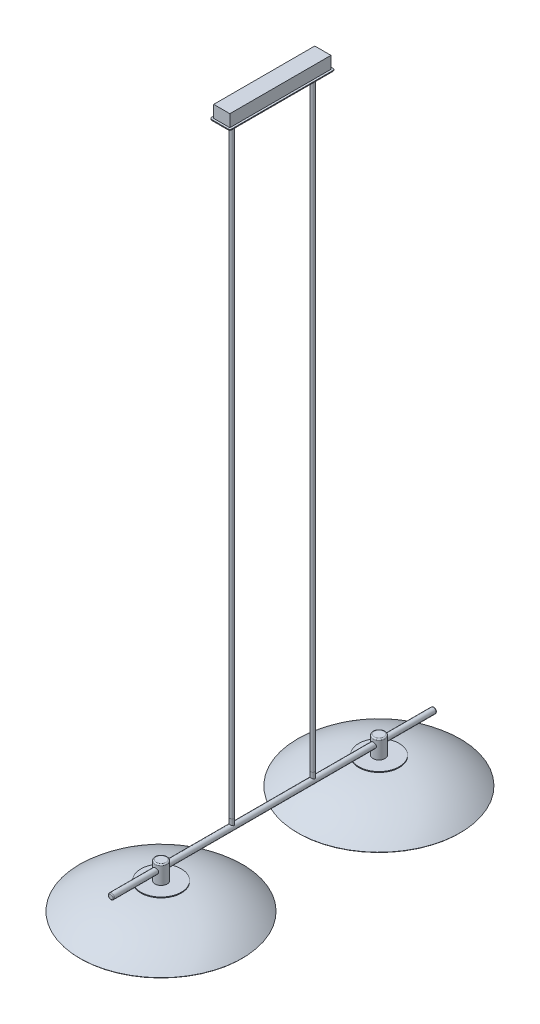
ISO-10303-21;
HEADER;
FILE_DESCRIPTION(('STEP AP214'),'2;1');
FILE_NAME('part.step','',(''),(''),'','','');
FILE_SCHEMA(('AUTOMOTIVE_DESIGN { 1 0 10303 214 1 1 1 1 }'));
ENDSEC;
DATA;
#1=APPLICATION_CONTEXT('core data for automotive mechanical design processes');
#2=APPLICATION_PROTOCOL_DEFINITION('international standard','automotive_design',2000,#1);
#3=PRODUCT_CONTEXT('',#1,'mechanical');
#4=PRODUCT('Part','Part','',(#3));
#5=PRODUCT_RELATED_PRODUCT_CATEGORY('part','',(#4));
#6=PRODUCT_DEFINITION_FORMATION('','',#4);
#7=PRODUCT_DEFINITION_CONTEXT('part definition',#1,'design');
#8=PRODUCT_DEFINITION('design','',#6,#7);
#9=PRODUCT_DEFINITION_SHAPE('','',#8);
#10=(LENGTH_UNIT() NAMED_UNIT(*) SI_UNIT(.MILLI.,.METRE.));
#11=(NAMED_UNIT(*) PLANE_ANGLE_UNIT() SI_UNIT($,.RADIAN.));
#12=(NAMED_UNIT(*) SI_UNIT($,.STERADIAN.) SOLID_ANGLE_UNIT());
#13=UNCERTAINTY_MEASURE_WITH_UNIT(LENGTH_MEASURE(1.E-05),#10,'distance_accuracy_value','');
#14=(GEOMETRIC_REPRESENTATION_CONTEXT(3) GLOBAL_UNCERTAINTY_ASSIGNED_CONTEXT((#13)) GLOBAL_UNIT_ASSIGNED_CONTEXT((#10,
#11,#12)) REPRESENTATION_CONTEXT('',''));
#15=CARTESIAN_POINT('',(0.,0.,0.));
#16=DIRECTION('',(0.,0.,1.));
#17=DIRECTION('',(1.,0.,0.));
#18=AXIS2_PLACEMENT_3D('',#15,#16,#17);
#19=CARTESIAN_POINT('',(-2.14282859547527,-28.6656904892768,686.171348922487));
#20=DIRECTION('',(0.,1.,0.));
#21=DIRECTION('',(0.,0.,1.));
#22=AXIS2_PLACEMENT_3D('',#19,#20,#21);
#23=PLANE('',#22);
#24=CARTESIAN_POINT('',(-2.14282859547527,-28.6656904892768,686.171348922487));
#25=DIRECTION('',(0.,1.,0.));
#26=DIRECTION('',(0.,0.,1.));
#27=AXIS2_PLACEMENT_3D('',#24,#25,#26);
#28=CIRCLE('',#27,15.);
#29=CARTESIAN_POINT('',(-2.14282859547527,-28.6656904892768,701.171348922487));
#30=VERTEX_POINT('',#29);
#31=EDGE_CURVE('P0_E28',#30,#30,#28,.T.);
#32=ORIENTED_EDGE('',*,*,#31,.F.);
#33=EDGE_LOOP('',(#32));
#34=FACE_BOUND('',#33,.T.);
#35=ADVANCED_FACE('P0_F17',(#34),#23,.F.);
#36=CARTESIAN_POINT('',(-2.14282859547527,16.3343095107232,686.171348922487));
#37=DIRECTION('',(0.,1.,0.));
#38=DIRECTION('',(0.,0.,1.));
#39=AXIS2_PLACEMENT_3D('',#36,#37,#38);
#40=PLANE('',#39);
#41=CARTESIAN_POINT('',(-2.14282859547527,16.3343095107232,686.171348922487));
#42=DIRECTION('',(0.,1.,0.));
#43=DIRECTION('',(0.,0.,1.));
#44=AXIS2_PLACEMENT_3D('',#41,#42,#43);
#45=CIRCLE('',#44,12.);
#46=CARTESIAN_POINT('',(-2.14282859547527,16.3343095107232,698.171348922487));
#47=VERTEX_POINT('',#46);
#48=EDGE_CURVE('P0_E24',#47,#47,#45,.T.);
#49=ORIENTED_EDGE('',*,*,#48,.T.);
#50=EDGE_LOOP('',(#49));
#51=FACE_BOUND('',#50,.T.);
#52=ADVANCED_FACE('P0_F34',(#51),#40,.T.);
#53=CARTESIAN_POINT('',(-2.14282859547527,-28.6656904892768,686.171348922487));
#54=DIRECTION('',(0.,1.,0.));
#55=DIRECTION('',(0.,0.,1.));
#56=AXIS2_PLACEMENT_3D('',#53,#54,#55);
#57=CYLINDRICAL_SURFACE('',#56,15.);
#58=CARTESIAN_POINT('',(-2.14282859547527,13.3343095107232,686.171348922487));
#59=DIRECTION('',(0.,1.,0.));
#60=DIRECTION('',(0.,0.,1.));
#61=AXIS2_PLACEMENT_3D('',#58,#59,#60);
#62=CIRCLE('',#61,15.);
#63=CARTESIAN_POINT('',(-2.14282859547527,13.3343095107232,701.171348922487));
#64=VERTEX_POINT('',#63);
#65=EDGE_CURVE('P0_E11',#64,#64,#62,.F.);
#66=ORIENTED_EDGE('',*,*,#65,.T.);
#67=EDGE_LOOP('',(#66));
#68=FACE_BOUND('',#67,.T.);
#69=ORIENTED_EDGE('',*,*,#31,.T.);
#70=EDGE_LOOP('',(#69));
#71=FACE_BOUND('',#70,.T.);
#72=ADVANCED_FACE('P0_F37',(#68,#71),#57,.T.);
#73=CARTESIAN_POINT('',(-2.14282859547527,13.3343095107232,686.171348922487));
#74=DIRECTION('',(0.,1.,0.));
#75=DIRECTION('',(0.,0.,1.));
#76=AXIS2_PLACEMENT_3D('',#73,#74,#75);
#77=TOROIDAL_SURFACE('',#76,12.,3.);
#78=ORIENTED_EDGE('',*,*,#65,.F.);
#79=EDGE_LOOP('',(#78));
#80=FACE_BOUND('',#79,.T.);
#81=ORIENTED_EDGE('',*,*,#48,.F.);
#82=EDGE_LOOP('',(#81));
#83=FACE_BOUND('',#82,.T.);
#84=ADVANCED_FACE('P0_F19',(#80,#83),#77,.T.);
#85=CLOSED_SHELL('',(#35,#52,#72,#84));
#86=MANIFOLD_SOLID_BREP('P0_B1',#85);
#87=CARTESIAN_POINT('',(-29.2663503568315,-296.82465382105,686.171348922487));
#88=DIRECTION('',(0.,0.,-1.));
#89=DIRECTION('',(-1.,0.,0.));
#90=AXIS2_PLACEMENT_3D('',#87,#88,#89);
#91=CIRCLE('',#90,265.);
#92=TRIMMED_CURVE('',#91,(PARAMETER_VALUE(-1.67228682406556)),
(PARAMETER_VALUE(1.67228682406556)),.T.,.PARAMETER.);
#93=CARTESIAN_POINT('',(-2.41751596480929,-296.82465382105,686.171348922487));
#94=DIRECTION('',(0.,1.,0.));
#95=AXIS1_PLACEMENT('',#93,#94);
#96=SURFACE_OF_REVOLUTION('',#92,#95);
#97=CARTESIAN_POINT('',(-2.41751596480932,-33.1882752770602,686.171348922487));
#98=VERTEX_POINT('',#97);
#99=VERTEX_LOOP('',#98);
#100=FACE_BOUND('',#99,.T.);
#101=CARTESIAN_POINT('',(-2.41751596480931,-96.2163941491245,686.171348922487));
#102=DIRECTION('',(0.,1.,0.));
#103=DIRECTION('',(-1.,0.,0.));
#104=AXIS2_PLACEMENT_3D('',#101,#102,#103);
#105=CIRCLE('',#104,200.);
#106=CARTESIAN_POINT('',(-202.417515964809,-96.2163941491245,686.171348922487));
#107=VERTEX_POINT('',#106);
#108=EDGE_CURVE('P1_E11',#107,#107,#105,.T.);
#109=ORIENTED_EDGE('',*,*,#108,.F.);
#110=EDGE_LOOP('',(#109));
#111=FACE_BOUND('',#110,.T.);
#112=ADVANCED_FACE('P1_F17',(#100,#111),#96,.F.);
#113=CARTESIAN_POINT('',(-2.41751596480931,-94.7023695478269,686.171348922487));
#114=DIRECTION('',(0.,1.,0.));
#115=DIRECTION('',(-1.,0.,0.));
#116=AXIS2_PLACEMENT_3D('',#113,#114,#115);
#117=CONICAL_SURFACE('',#116,201.306801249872,0.712067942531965);
#118=ORIENTED_EDGE('',*,*,#108,.T.);
#119=EDGE_LOOP('',(#118));
#120=FACE_BOUND('',#119,.T.);
#121=CARTESIAN_POINT('',(-2.41751596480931,-94.7023695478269,686.171348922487));
#122=DIRECTION('',(0.,1.,0.));
#123=DIRECTION('',(-1.,0.,0.));
#124=AXIS2_PLACEMENT_3D('',#121,#122,#123);
#125=CIRCLE('',#124,201.306801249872);
#126=CARTESIAN_POINT('',(-203.724317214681,-94.7023695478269,686.171348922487));
#127=VERTEX_POINT('',#126);
#128=EDGE_CURVE('P1_E24',#127,#127,#125,.T.);
#129=ORIENTED_EDGE('',*,*,#128,.F.);
#130=EDGE_LOOP('',(#129));
#131=FACE_BOUND('',#130,.T.);
#132=ADVANCED_FACE('P1_F32',(#120,#131),#117,.T.);
#133=CARTESIAN_POINT('',(-29.2663503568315,-296.82465382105,686.171348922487));
#134=DIRECTION('',(0.,0.,-1.));
#135=DIRECTION('',(-1.,0.,0.));
#136=AXIS2_PLACEMENT_3D('',#133,#134,#135);
#137=CIRCLE('',#136,267.);
#138=TRIMMED_CURVE('',#137,(PARAMETER_VALUE(-1.67152400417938)),
(PARAMETER_VALUE(1.67152400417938)),.T.,.PARAMETER.);
#139=CARTESIAN_POINT('',(-2.41751596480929,-296.82465382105,686.171348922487));
#140=DIRECTION('',(0.,1.,0.));
#141=AXIS1_PLACEMENT('',#139,#140);
#142=SURFACE_OF_REVOLUTION('',#138,#141);
#143=ORIENTED_EDGE('',*,*,#128,.T.);
#144=EDGE_LOOP('',(#143));
#145=FACE_BOUND('',#144,.T.);
#146=CARTESIAN_POINT('',(-2.41751596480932,-31.1780086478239,686.171348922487));
#147=VERTEX_POINT('',#146);
#148=VERTEX_LOOP('',#147);
#149=FACE_BOUND('',#148,.T.);
#150=ADVANCED_FACE('P1_F37',(#145,#149),#142,.T.);
#151=CLOSED_SHELL('',(#112,#132,#150));
#152=MANIFOLD_SOLID_BREP('P1_B1',#151);
#153=CARTESIAN_POINT('',(-2.14282859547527,-28.6656904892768,686.171348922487));
#154=DIRECTION('',(0.,-1.,0.));
#155=DIRECTION('',(0.,0.,-1.));
#156=AXIS2_PLACEMENT_3D('',#153,#154,#155);
#157=CYLINDRICAL_SURFACE('',#156,50.);
#158=CARTESIAN_POINT('',(-2.14282859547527,-28.6656904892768,686.171348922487));
#159=DIRECTION('',(0.,1.,0.));
#160=DIRECTION('',(0.,0.,1.));
#161=AXIS2_PLACEMENT_3D('',#158,#159,#160);
#162=CIRCLE('',#161,50.);
#163=CARTESIAN_POINT('',(-2.14282859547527,-28.6656904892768,736.171348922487));
#164=VERTEX_POINT('',#163);
#165=EDGE_CURVE('P2_E10',#164,#164,#162,.T.);
#166=ORIENTED_EDGE('',*,*,#165,.F.);
#167=EDGE_LOOP('',(#166));
#168=FACE_BOUND('',#167,.T.);
#169=CARTESIAN_POINT('',(-2.14282859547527,-30.6656904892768,686.171348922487));
#170=DIRECTION('',(0.,1.,0.));
#171=DIRECTION('',(0.,0.,1.));
#172=AXIS2_PLACEMENT_3D('',#169,#170,#171);
#173=CIRCLE('',#172,50.);
#174=CARTESIAN_POINT('',(-2.14282859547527,-30.6656904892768,736.171348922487));
#175=VERTEX_POINT('',#174);
#176=EDGE_CURVE('P2_E18',#175,#175,#173,.T.);
#177=ORIENTED_EDGE('',*,*,#176,.T.);
#178=EDGE_LOOP('',(#177));
#179=FACE_BOUND('',#178,.T.);
#180=ADVANCED_FACE('P2_F15',(#168,#179),#157,.T.);
#181=CARTESIAN_POINT('',(-2.14282859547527,-28.6656904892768,686.171348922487));
#182=DIRECTION('',(0.,1.,0.));
#183=DIRECTION('',(0.,0.,1.));
#184=AXIS2_PLACEMENT_3D('',#181,#182,#183);
#185=PLANE('',#184);
#186=ORIENTED_EDGE('',*,*,#165,.T.);
#187=EDGE_LOOP('',(#186));
#188=FACE_BOUND('',#187,.T.);
#189=ADVANCED_FACE('P2_F30',(#188),#185,.T.);
#190=CARTESIAN_POINT('',(-2.14282859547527,-30.6656904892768,686.171348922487));
#191=DIRECTION('',(0.,1.,0.));
#192=DIRECTION('',(0.,0.,1.));
#193=AXIS2_PLACEMENT_3D('',#190,#191,#192);
#194=PLANE('',#193);
#195=ORIENTED_EDGE('',*,*,#176,.F.);
#196=EDGE_LOOP('',(#195));
#197=FACE_BOUND('',#196,.T.);
#198=ADVANCED_FACE('P2_F28',(#197),#194,.F.);
#199=CLOSED_SHELL('',(#180,#189,#198));
#200=MANIFOLD_SOLID_BREP('P2_B1',#199);
#201=CARTESIAN_POINT('',(-2.14282859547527,-70.6656904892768,686.171348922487));
#202=DIRECTION('',(0.,1.,0.));
#203=DIRECTION('',(0.,0.,1.));
#204=AXIS2_PLACEMENT_3D('',#201,#202,#203);
#205=CYLINDRICAL_SURFACE('',#204,50.);
#206=CARTESIAN_POINT('',(-2.14282859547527,-60.6656904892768,686.171348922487));
#207=DIRECTION('',(0.,-1.,0.));
#208=DIRECTION('',(0.,0.,-1.));
#209=AXIS2_PLACEMENT_3D('',#206,#207,#208);
#210=CIRCLE('',#209,50.);
#211=CARTESIAN_POINT('',(-2.14282859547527,-60.6656904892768,636.171348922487));
#212=VERTEX_POINT('',#211);
#213=EDGE_CURVE('P3_E10',#212,#212,#210,.F.);
#214=ORIENTED_EDGE('',*,*,#213,.T.);
#215=EDGE_LOOP('',(#214));
#216=FACE_BOUND('',#215,.T.);
#217=CARTESIAN_POINT('',(-2.14282859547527,-55.6656904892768,686.171348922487));
#218=DIRECTION('',(0.,-1.,0.));
#219=DIRECTION('',(0.,0.,-1.));
#220=AXIS2_PLACEMENT_3D('',#217,#218,#219);
#221=CIRCLE('',#220,50.);
#222=CARTESIAN_POINT('',(-2.14282859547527,-55.6656904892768,636.171348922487));
#223=VERTEX_POINT('',#222);
#224=EDGE_CURVE('P3_E26',#223,#223,#221,.T.);
#225=ORIENTED_EDGE('',*,*,#224,.T.);
#226=EDGE_LOOP('',(#225));
#227=FACE_BOUND('',#226,.T.);
#228=ADVANCED_FACE('P3_F15',(#216,#227),#205,.T.);
#229=CARTESIAN_POINT('',(-2.14282859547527,-70.6656904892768,686.171348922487));
#230=DIRECTION('',(0.,-1.,0.));
#231=DIRECTION('',(0.,0.,-1.));
#232=AXIS2_PLACEMENT_3D('',#229,#230,#231);
#233=PLANE('',#232);
#234=CARTESIAN_POINT('',(-2.14282859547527,-70.6656904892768,686.171348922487));
#235=DIRECTION('',(0.,-1.,0.));
#236=DIRECTION('',(0.,0.,-1.));
#237=AXIS2_PLACEMENT_3D('',#234,#235,#236);
#238=CIRCLE('',#237,40.);
#239=CARTESIAN_POINT('',(-2.14282859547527,-70.6656904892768,646.171348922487));
#240=VERTEX_POINT('',#239);
#241=EDGE_CURVE('P3_E22',#240,#240,#238,.T.);
#242=ORIENTED_EDGE('',*,*,#241,.T.);
#243=EDGE_LOOP('',(#242));
#244=FACE_BOUND('',#243,.T.);
#245=ADVANCED_FACE('P3_F36',(#244),#233,.T.);
#246=CARTESIAN_POINT('',(-2.14282859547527,-55.6656904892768,686.171348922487));
#247=DIRECTION('',(0.,-1.,0.));
#248=DIRECTION('',(0.,0.,-1.));
#249=AXIS2_PLACEMENT_3D('',#246,#247,#248);
#250=PLANE('',#249);
#251=ORIENTED_EDGE('',*,*,#224,.F.);
#252=EDGE_LOOP('',(#251));
#253=FACE_BOUND('',#252,.T.);
#254=ADVANCED_FACE('P3_F34',(#253),#250,.F.);
#255=CARTESIAN_POINT('',(-2.14282859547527,-60.6656904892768,686.171348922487));
#256=DIRECTION('',(0.,-1.,0.));
#257=DIRECTION('',(0.,0.,-1.));
#258=AXIS2_PLACEMENT_3D('',#255,#256,#257);
#259=TOROIDAL_SURFACE('',#258,40.,10.);
#260=ORIENTED_EDGE('',*,*,#213,.F.);
#261=EDGE_LOOP('',(#260));
#262=FACE_BOUND('',#261,.T.);
#263=ORIENTED_EDGE('',*,*,#241,.F.);
#264=EDGE_LOOP('',(#263));
#265=FACE_BOUND('',#264,.T.);
#266=ADVANCED_FACE('P3_F17',(#262,#265),#259,.T.);
#267=CLOSED_SHELL('',(#228,#245,#254,#266));
#268=MANIFOLD_SOLID_BREP('P3_B1',#267);
#269=CARTESIAN_POINT('',(-2.14282859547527,-55.6656904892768,686.171348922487));
#270=DIRECTION('',(0.,1.,0.));
#271=DIRECTION('',(0.,0.,1.));
#272=AXIS2_PLACEMENT_3D('',#269,#270,#271);
#273=CYLINDRICAL_SURFACE('',#272,50.);
#274=CARTESIAN_POINT('',(-2.14282859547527,-55.6656904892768,686.171348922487));
#275=DIRECTION('',(0.,-1.,0.));
#276=DIRECTION('',(0.,0.,-1.));
#277=AXIS2_PLACEMENT_3D('',#274,#275,#276);
#278=CIRCLE('',#277,50.);
#279=CARTESIAN_POINT('',(-2.14282859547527,-55.6656904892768,636.171348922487));
#280=VERTEX_POINT('',#279);
#281=EDGE_CURVE('P4_E10',#280,#280,#278,.T.);
#282=ORIENTED_EDGE('',*,*,#281,.F.);
#283=EDGE_LOOP('',(#282));
#284=FACE_BOUND('',#283,.T.);
#285=CARTESIAN_POINT('',(-2.14282859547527,-35.6656904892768,686.171348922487));
#286=DIRECTION('',(0.,-1.,0.));
#287=DIRECTION('',(0.,0.,-1.));
#288=AXIS2_PLACEMENT_3D('',#285,#286,#287);
#289=CIRCLE('',#288,50.);
#290=CARTESIAN_POINT('',(-2.14282859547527,-35.6656904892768,636.171348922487));
#291=VERTEX_POINT('',#290);
#292=EDGE_CURVE('P4_E18',#291,#291,#289,.T.);
#293=ORIENTED_EDGE('',*,*,#292,.T.);
#294=EDGE_LOOP('',(#293));
#295=FACE_BOUND('',#294,.T.);
#296=ADVANCED_FACE('P4_F15',(#284,#295),#273,.T.);
#297=CARTESIAN_POINT('',(-2.14282859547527,-55.6656904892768,686.171348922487));
#298=DIRECTION('',(0.,-1.,0.));
#299=DIRECTION('',(0.,0.,-1.));
#300=AXIS2_PLACEMENT_3D('',#297,#298,#299);
#301=PLANE('',#300);
#302=ORIENTED_EDGE('',*,*,#281,.T.);
#303=EDGE_LOOP('',(#302));
#304=FACE_BOUND('',#303,.T.);
#305=ADVANCED_FACE('P4_F30',(#304),#301,.T.);
#306=CARTESIAN_POINT('',(-2.14282859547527,-35.6656904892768,686.171348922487));
#307=DIRECTION('',(0.,-1.,0.));
#308=DIRECTION('',(0.,0.,-1.));
#309=AXIS2_PLACEMENT_3D('',#306,#307,#308);
#310=PLANE('',#309);
#311=ORIENTED_EDGE('',*,*,#292,.F.);
#312=EDGE_LOOP('',(#311));
#313=FACE_BOUND('',#312,.T.);
#314=ADVANCED_FACE('P4_F28',(#313),#310,.F.);
#315=CLOSED_SHELL('',(#296,#305,#314));
#316=MANIFOLD_SOLID_BREP('P4_B1',#315);
#317=CARTESIAN_POINT('',(-2.14282859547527,-35.6656904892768,686.171348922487));
#318=DIRECTION('',(0.,1.,0.));
#319=DIRECTION('',(0.,0.,1.));
#320=AXIS2_PLACEMENT_3D('',#317,#318,#319);
#321=CYLINDRICAL_SURFACE('',#320,50.);
#322=CARTESIAN_POINT('',(-2.14282859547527,-35.6656904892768,686.171348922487));
#323=DIRECTION('',(0.,-1.,0.));
#324=DIRECTION('',(0.,0.,-1.));
#325=AXIS2_PLACEMENT_3D('',#322,#323,#324);
#326=CIRCLE('',#325,50.);
#327=CARTESIAN_POINT('',(-2.14282859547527,-35.6656904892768,636.171348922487));
#328=VERTEX_POINT('',#327);
#329=EDGE_CURVE('P5_E10',#328,#328,#326,.T.);
#330=ORIENTED_EDGE('',*,*,#329,.F.);
#331=EDGE_LOOP('',(#330));
#332=FACE_BOUND('',#331,.T.);
#333=CARTESIAN_POINT('',(-2.14282859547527,-33.6656904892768,686.171348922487));
#334=DIRECTION('',(0.,-1.,0.));
#335=DIRECTION('',(0.,0.,-1.));
#336=AXIS2_PLACEMENT_3D('',#333,#334,#335);
#337=CIRCLE('',#336,50.);
#338=CARTESIAN_POINT('',(-2.14282859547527,-33.6656904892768,636.171348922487));
#339=VERTEX_POINT('',#338);
#340=EDGE_CURVE('P5_E18',#339,#339,#337,.T.);
#341=ORIENTED_EDGE('',*,*,#340,.T.);
#342=EDGE_LOOP('',(#341));
#343=FACE_BOUND('',#342,.T.);
#344=ADVANCED_FACE('P5_F15',(#332,#343),#321,.T.);
#345=CARTESIAN_POINT('',(-2.14282859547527,-35.6656904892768,686.171348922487));
#346=DIRECTION('',(0.,-1.,0.));
#347=DIRECTION('',(0.,0.,-1.));
#348=AXIS2_PLACEMENT_3D('',#345,#346,#347);
#349=PLANE('',#348);
#350=ORIENTED_EDGE('',*,*,#329,.T.);
#351=EDGE_LOOP('',(#350));
#352=FACE_BOUND('',#351,.T.);
#353=ADVANCED_FACE('P5_F30',(#352),#349,.T.);
#354=CARTESIAN_POINT('',(-2.14282859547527,-33.6656904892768,686.171348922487));
#355=DIRECTION('',(0.,-1.,0.));
#356=DIRECTION('',(0.,0.,-1.));
#357=AXIS2_PLACEMENT_3D('',#354,#355,#356);
#358=PLANE('',#357);
#359=ORIENTED_EDGE('',*,*,#340,.F.);
#360=EDGE_LOOP('',(#359));
#361=FACE_BOUND('',#360,.T.);
#362=ADVANCED_FACE('P5_F28',(#361),#358,.F.);
#363=CLOSED_SHELL('',(#344,#353,#362));
#364=MANIFOLD_SOLID_BREP('P5_B1',#363);
#365=CARTESIAN_POINT('',(-2.23220899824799,1509.75927157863,850.));
#366=DIRECTION('',(0.,1.,0.));
#367=DIRECTION('',(0.,0.,1.));
#368=AXIS2_PLACEMENT_3D('',#365,#366,#367);
#369=CYLINDRICAL_SURFACE('',#368,4.);
#370=CARTESIAN_POINT('',(-2.23220899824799,1509.75927157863,850.));
#371=DIRECTION('',(0.,-1.,0.));
#372=DIRECTION('',(0.,0.,-1.));
#373=AXIS2_PLACEMENT_3D('',#370,#371,#372);
#374=CIRCLE('',#373,4.);
#375=CARTESIAN_POINT('',(-2.23220899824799,1509.75927157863,846.));
#376=VERTEX_POINT('',#375);
#377=EDGE_CURVE('P6_E10',#376,#376,#374,.T.);
#378=ORIENTED_EDGE('',*,*,#377,.F.);
#379=EDGE_LOOP('',(#378));
#380=FACE_BOUND('',#379,.T.);
#381=CARTESIAN_POINT('',(-2.23220899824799,1517.75927157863,850.));
#382=DIRECTION('',(0.,-1.,0.));
#383=DIRECTION('',(0.,0.,-1.));
#384=AXIS2_PLACEMENT_3D('',#381,#382,#383);
#385=CIRCLE('',#384,4.);
#386=CARTESIAN_POINT('',(-2.23220899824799,1517.75927157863,846.));
#387=VERTEX_POINT('',#386);
#388=EDGE_CURVE('P6_E18',#387,#387,#385,.T.);
#389=ORIENTED_EDGE('',*,*,#388,.T.);
#390=EDGE_LOOP('',(#389));
#391=FACE_BOUND('',#390,.T.);
#392=ADVANCED_FACE('P6_F15',(#380,#391),#369,.T.);
#393=CARTESIAN_POINT('',(-2.23220899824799,1509.75927157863,850.));
#394=DIRECTION('',(0.,-1.,0.));
#395=DIRECTION('',(0.,0.,-1.));
#396=AXIS2_PLACEMENT_3D('',#393,#394,#395);
#397=PLANE('',#396);
#398=ORIENTED_EDGE('',*,*,#377,.T.);
#399=EDGE_LOOP('',(#398));
#400=FACE_BOUND('',#399,.T.);
#401=ADVANCED_FACE('P6_F30',(#400),#397,.T.);
#402=CARTESIAN_POINT('',(-2.23220899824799,1517.75927157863,850.));
#403=DIRECTION('',(0.,-1.,0.));
#404=DIRECTION('',(0.,0.,-1.));
#405=AXIS2_PLACEMENT_3D('',#402,#403,#404);
#406=PLANE('',#405);
#407=ORIENTED_EDGE('',*,*,#388,.F.);
#408=EDGE_LOOP('',(#407));
#409=FACE_BOUND('',#408,.T.);
#410=ADVANCED_FACE('P6_F28',(#409),#406,.F.);
#411=CLOSED_SHELL('',(#392,#401,#410));
#412=MANIFOLD_SOLID_BREP('P6_B1',#411);
#413=CARTESIAN_POINT('',(-2.23220899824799,1512.75927157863,990.));
#414=DIRECTION('',(0.,1.,0.));
#415=DIRECTION('',(0.,0.,1.));
#416=AXIS2_PLACEMENT_3D('',#413,#414,#415);
#417=CYLINDRICAL_SURFACE('',#416,2.5);
#418=CARTESIAN_POINT('',(-2.23220899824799,1513.75927157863,990.));
#419=DIRECTION('',(0.,-1.,0.));
#420=DIRECTION('',(0.,0.,-1.));
#421=AXIS2_PLACEMENT_3D('',#418,#419,#420);
#422=CIRCLE('',#421,2.5);
#423=CARTESIAN_POINT('',(-2.23220899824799,1513.75927157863,987.5));
#424=VERTEX_POINT('',#423);
#425=EDGE_CURVE('P7_E10',#424,#424,#422,.F.);
#426=ORIENTED_EDGE('',*,*,#425,.T.);
#427=EDGE_LOOP('',(#426));
#428=FACE_BOUND('',#427,.T.);
#429=CARTESIAN_POINT('',(-2.23220899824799,1517.75927157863,990.));
#430=DIRECTION('',(0.,-1.,0.));
#431=DIRECTION('',(0.,0.,-1.));
#432=AXIS2_PLACEMENT_3D('',#429,#430,#431);
#433=CIRCLE('',#432,2.5);
#434=CARTESIAN_POINT('',(-2.23220899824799,1517.75927157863,987.5));
#435=VERTEX_POINT('',#434);
#436=EDGE_CURVE('P7_E26',#435,#435,#433,.T.);
#437=ORIENTED_EDGE('',*,*,#436,.T.);
#438=EDGE_LOOP('',(#437));
#439=FACE_BOUND('',#438,.T.);
#440=ADVANCED_FACE('P7_F15',(#428,#439),#417,.T.);
#441=CARTESIAN_POINT('',(-2.23220899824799,1512.75927157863,990.));
#442=DIRECTION('',(0.,-1.,0.));
#443=DIRECTION('',(0.,0.,-1.));
#444=AXIS2_PLACEMENT_3D('',#441,#442,#443);
#445=PLANE('',#444);
#446=CARTESIAN_POINT('',(-2.23220899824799,1512.75927157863,990.));
#447=DIRECTION('',(0.,-1.,0.));
#448=DIRECTION('',(0.,0.,-1.));
#449=AXIS2_PLACEMENT_3D('',#446,#447,#448);
#450=CIRCLE('',#449,1.5);
#451=CARTESIAN_POINT('',(-2.23220899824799,1512.75927157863,988.5));
#452=VERTEX_POINT('',#451);
#453=EDGE_CURVE('P7_E22',#452,#452,#450,.T.);
#454=ORIENTED_EDGE('',*,*,#453,.T.);
#455=EDGE_LOOP('',(#454));
#456=FACE_BOUND('',#455,.T.);
#457=ADVANCED_FACE('P7_F36',(#456),#445,.T.);
#458=CARTESIAN_POINT('',(-2.23220899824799,1517.75927157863,990.));
#459=DIRECTION('',(0.,-1.,0.));
#460=DIRECTION('',(0.,0.,-1.));
#461=AXIS2_PLACEMENT_3D('',#458,#459,#460);
#462=PLANE('',#461);
#463=ORIENTED_EDGE('',*,*,#436,.F.);
#464=EDGE_LOOP('',(#463));
#465=FACE_BOUND('',#464,.T.);
#466=ADVANCED_FACE('P7_F34',(#465),#462,.F.);
#467=CARTESIAN_POINT('',(-2.23220899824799,1513.75927157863,990.));
#468=DIRECTION('',(0.,-1.,0.));
#469=DIRECTION('',(0.,0.,-1.));
#470=AXIS2_PLACEMENT_3D('',#467,#468,#469);
#471=TOROIDAL_SURFACE('',#470,1.5,1.);
#472=ORIENTED_EDGE('',*,*,#425,.F.);
#473=EDGE_LOOP('',(#472));
#474=FACE_BOUND('',#473,.T.);
#475=ORIENTED_EDGE('',*,*,#453,.F.);
#476=EDGE_LOOP('',(#475));
#477=FACE_BOUND('',#476,.T.);
#478=ADVANCED_FACE('P7_F17',(#474,#477),#471,.T.);
#479=CLOSED_SHELL('',(#440,#457,#466,#478));
#480=MANIFOLD_SOLID_BREP('P7_B1',#479);
#481=CARTESIAN_POINT('',(-2.23220899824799,1512.75927157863,910.));
#482=DIRECTION('',(0.,1.,0.));
#483=DIRECTION('',(0.,0.,1.));
#484=AXIS2_PLACEMENT_3D('',#481,#482,#483);
#485=CYLINDRICAL_SURFACE('',#484,2.5);
#486=CARTESIAN_POINT('',(-2.23220899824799,1513.75927157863,910.));
#487=DIRECTION('',(0.,-1.,0.));
#488=DIRECTION('',(0.,0.,-1.));
#489=AXIS2_PLACEMENT_3D('',#486,#487,#488);
#490=CIRCLE('',#489,2.5);
#491=CARTESIAN_POINT('',(-2.23220899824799,1513.75927157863,907.5));
#492=VERTEX_POINT('',#491);
#493=EDGE_CURVE('P8_E10',#492,#492,#490,.F.);
#494=ORIENTED_EDGE('',*,*,#493,.T.);
#495=EDGE_LOOP('',(#494));
#496=FACE_BOUND('',#495,.T.);
#497=CARTESIAN_POINT('',(-2.23220899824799,1517.75927157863,910.));
#498=DIRECTION('',(0.,-1.,0.));
#499=DIRECTION('',(0.,0.,-1.));
#500=AXIS2_PLACEMENT_3D('',#497,#498,#499);
#501=CIRCLE('',#500,2.5);
#502=CARTESIAN_POINT('',(-2.23220899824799,1517.75927157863,907.5));
#503=VERTEX_POINT('',#502);
#504=EDGE_CURVE('P8_E26',#503,#503,#501,.T.);
#505=ORIENTED_EDGE('',*,*,#504,.T.);
#506=EDGE_LOOP('',(#505));
#507=FACE_BOUND('',#506,.T.);
#508=ADVANCED_FACE('P8_F15',(#496,#507),#485,.T.);
#509=CARTESIAN_POINT('',(-2.23220899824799,1512.75927157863,910.));
#510=DIRECTION('',(0.,-1.,0.));
#511=DIRECTION('',(0.,0.,-1.));
#512=AXIS2_PLACEMENT_3D('',#509,#510,#511);
#513=PLANE('',#512);
#514=CARTESIAN_POINT('',(-2.23220899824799,1512.75927157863,910.));
#515=DIRECTION('',(0.,-1.,0.));
#516=DIRECTION('',(0.,0.,-1.));
#517=AXIS2_PLACEMENT_3D('',#514,#515,#516);
#518=CIRCLE('',#517,1.5);
#519=CARTESIAN_POINT('',(-2.23220899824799,1512.75927157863,908.5));
#520=VERTEX_POINT('',#519);
#521=EDGE_CURVE('P8_E22',#520,#520,#518,.T.);
#522=ORIENTED_EDGE('',*,*,#521,.T.);
#523=EDGE_LOOP('',(#522));
#524=FACE_BOUND('',#523,.T.);
#525=ADVANCED_FACE('P8_F36',(#524),#513,.T.);
#526=CARTESIAN_POINT('',(-2.23220899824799,1517.75927157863,910.));
#527=DIRECTION('',(0.,-1.,0.));
#528=DIRECTION('',(0.,0.,-1.));
#529=AXIS2_PLACEMENT_3D('',#526,#527,#528);
#530=PLANE('',#529);
#531=ORIENTED_EDGE('',*,*,#504,.F.);
#532=EDGE_LOOP('',(#531));
#533=FACE_BOUND('',#532,.T.);
#534=ADVANCED_FACE('P8_F34',(#533),#530,.F.);
#535=CARTESIAN_POINT('',(-2.23220899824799,1513.75927157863,910.));
#536=DIRECTION('',(0.,-1.,0.));
#537=DIRECTION('',(0.,0.,-1.));
#538=AXIS2_PLACEMENT_3D('',#535,#536,#537);
#539=TOROIDAL_SURFACE('',#538,1.5,1.);
#540=ORIENTED_EDGE('',*,*,#493,.F.);
#541=EDGE_LOOP('',(#540));
#542=FACE_BOUND('',#541,.T.);
#543=ORIENTED_EDGE('',*,*,#521,.F.);
#544=EDGE_LOOP('',(#543));
#545=FACE_BOUND('',#544,.T.);
#546=ADVANCED_FACE('P8_F17',(#542,#545),#539,.T.);
#547=CLOSED_SHELL('',(#508,#525,#534,#546));
#548=MANIFOLD_SOLID_BREP('P8_B1',#547);
#549=CARTESIAN_POINT('',(22.767791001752,1517.75927157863,1080.));
#550=DIRECTION('',(-1.,0.,0.));
#551=DIRECTION('',(0.,0.,1.));
#552=AXIS2_PLACEMENT_3D('',#549,#550,#551);
#553=PLANE('',#552);
#554=DIRECTION('',(0.,0.,1.));
#555=VECTOR('',#554,1.);
#556=CARTESIAN_POINT('',(22.767791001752,1519.75927157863,1080.));
#557=LINE('',#556,#555);
#558=CARTESIAN_POINT('',(22.7677910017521,1519.75927157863,825.));
#559=VERTEX_POINT('',#558);
#560=CARTESIAN_POINT('',(22.767791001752,1519.75927157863,1075.));
#561=VERTEX_POINT('',#560);
#562=EDGE_CURVE('P9_E112',#559,#561,#557,.T.);
#563=ORIENTED_EDGE('',*,*,#562,.T.);
#564=DIRECTION('',(0.,1.,0.));
#565=VECTOR('',#564,1.);
#566=CARTESIAN_POINT('',(22.767791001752,1517.75927157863,1075.));
#567=LINE('',#566,#565);
#568=CARTESIAN_POINT('',(22.767791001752,1517.75927157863,1075.));
#569=VERTEX_POINT('',#568);
#570=EDGE_CURVE('P9_E135',#561,#569,#567,.F.);
#571=ORIENTED_EDGE('',*,*,#570,.T.);
#572=DIRECTION('',(0.,0.,1.));
#573=VECTOR('',#572,1.);
#574=CARTESIAN_POINT('',(22.767791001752,1517.75927157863,1080.));
#575=LINE('',#574,#573);
#576=CARTESIAN_POINT('',(22.7677910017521,1517.75927157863,825.));
#577=VERTEX_POINT('',#576);
#578=EDGE_CURVE('P9_E110',#577,#569,#575,.T.);
#579=ORIENTED_EDGE('',*,*,#578,.F.);
#580=DIRECTION('',(0.,1.,0.));
#581=VECTOR('',#580,1.);
#582=CARTESIAN_POINT('',(22.7677910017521,1517.75927157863,825.));
#583=LINE('',#582,#581);
#584=EDGE_CURVE('P9_E132',#577,#559,#583,.T.);
#585=ORIENTED_EDGE('',*,*,#584,.T.);
#586=EDGE_LOOP('',(#563,#571,#579,#585));
#587=FACE_BOUND('',#586,.T.);
#588=ADVANCED_FACE('P9_F17',(#587),#553,.F.);
#589=CARTESIAN_POINT('',(-27.232208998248,1517.75927157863,1080.));
#590=DIRECTION('',(0.,0.,-1.));
#591=DIRECTION('',(-1.,0.,0.));
#592=AXIS2_PLACEMENT_3D('',#589,#590,#591);
#593=PLANE('',#592);
#594=DIRECTION('',(-1.,0.,0.));
#595=VECTOR('',#594,1.);
#596=CARTESIAN_POINT('',(-27.232208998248,1519.75927157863,1080.));
#597=LINE('',#596,#595);
#598=CARTESIAN_POINT('',(17.767791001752,1519.75927157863,1080.));
#599=VERTEX_POINT('',#598);
#600=CARTESIAN_POINT('',(-22.232208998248,1519.75927157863,1080.));
#601=VERTEX_POINT('',#600);
#602=EDGE_CURVE('P9_E108',#599,#601,#597,.T.);
#603=ORIENTED_EDGE('',*,*,#602,.T.);
#604=DIRECTION('',(0.,1.,0.));
#605=VECTOR('',#604,1.);
#606=CARTESIAN_POINT('',(-22.232208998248,1517.75927157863,1080.));
#607=LINE('',#606,#605);
#608=CARTESIAN_POINT('',(-22.232208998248,1517.75927157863,1080.));
#609=VERTEX_POINT('',#608);
#610=EDGE_CURVE('P9_E87',#601,#609,#607,.F.);
#611=ORIENTED_EDGE('',*,*,#610,.T.);
#612=DIRECTION('',(-1.,0.,0.));
#613=VECTOR('',#612,1.);
#614=CARTESIAN_POINT('',(-27.232208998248,1517.75927157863,1080.));
#615=LINE('',#614,#613);
#616=CARTESIAN_POINT('',(17.767791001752,1517.75927157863,1080.));
#617=VERTEX_POINT('',#616);
#618=EDGE_CURVE('P9_E151',#617,#609,#615,.T.);
#619=ORIENTED_EDGE('',*,*,#618,.F.);
#620=DIRECTION('',(0.,1.,0.));
#621=VECTOR('',#620,1.);
#622=CARTESIAN_POINT('',(17.767791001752,1517.75927157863,1080.));
#623=LINE('',#622,#621);
#624=EDGE_CURVE('P9_E92',#617,#599,#623,.T.);
#625=ORIENTED_EDGE('',*,*,#624,.T.);
#626=EDGE_LOOP('',(#603,#611,#619,#625));
#627=FACE_BOUND('',#626,.T.);
#628=ADVANCED_FACE('P9_F169',(#627),#593,.F.);
#629=CARTESIAN_POINT('',(-27.232208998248,1517.75927157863,1080.));
#630=DIRECTION('',(1.,0.,0.));
#631=DIRECTION('',(0.,0.,-1.));
#632=AXIS2_PLACEMENT_3D('',#629,#630,#631);
#633=PLANE('',#632);
#634=DIRECTION('',(0.,0.,-1.));
#635=VECTOR('',#634,1.);
#636=CARTESIAN_POINT('',(-27.232208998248,1517.75927157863,1080.));
#637=LINE('',#636,#635);
#638=CARTESIAN_POINT('',(-27.232208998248,1517.75927157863,1075.));
#639=VERTEX_POINT('',#638);
#640=CARTESIAN_POINT('',(-27.2322089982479,1517.75927157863,825.));
#641=VERTEX_POINT('',#640);
#642=EDGE_CURVE('P9_E101',#639,#641,#637,.T.);
#643=ORIENTED_EDGE('',*,*,#642,.F.);
#644=DIRECTION('',(0.,1.,0.));
#645=VECTOR('',#644,1.);
#646=CARTESIAN_POINT('',(-27.232208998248,1517.75927157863,1075.));
#647=LINE('',#646,#645);
#648=CARTESIAN_POINT('',(-27.232208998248,1519.75927157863,1075.));
#649=VERTEX_POINT('',#648);
#650=EDGE_CURVE('P9_E86',#639,#649,#647,.T.);
#651=ORIENTED_EDGE('',*,*,#650,.T.);
#652=DIRECTION('',(0.,0.,-1.));
#653=VECTOR('',#652,1.);
#654=CARTESIAN_POINT('',(-27.232208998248,1519.75927157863,1080.));
#655=LINE('',#654,#653);
#656=CARTESIAN_POINT('',(-27.2322089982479,1519.75927157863,825.));
#657=VERTEX_POINT('',#656);
#658=EDGE_CURVE('P9_E99',#649,#657,#655,.T.);
#659=ORIENTED_EDGE('',*,*,#658,.T.);
#660=DIRECTION('',(0.,1.,0.));
#661=VECTOR('',#660,1.);
#662=CARTESIAN_POINT('',(-27.2322089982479,1517.75927157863,825.));
#663=LINE('',#662,#661);
#664=EDGE_CURVE('P9_E103',#657,#641,#663,.F.);
#665=ORIENTED_EDGE('',*,*,#664,.T.);
#666=EDGE_LOOP('',(#643,#651,#659,#665));
#667=FACE_BOUND('',#666,.T.);
#668=ADVANCED_FACE('P9_F98',(#667),#633,.F.);
#669=CARTESIAN_POINT('',(-27.2322089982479,1517.75927157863,820.));
#670=DIRECTION('',(0.,0.,1.));
#671=DIRECTION('',(1.,0.,0.));
#672=AXIS2_PLACEMENT_3D('',#669,#670,#671);
#673=PLANE('',#672);
#674=DIRECTION('',(1.,0.,0.));
#675=VECTOR('',#674,1.);
#676=CARTESIAN_POINT('',(-27.2322089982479,1519.75927157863,820.));
#677=LINE('',#676,#675);
#678=CARTESIAN_POINT('',(-22.2322089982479,1519.75927157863,820.));
#679=VERTEX_POINT('',#678);
#680=CARTESIAN_POINT('',(17.7677910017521,1519.75927157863,820.));
#681=VERTEX_POINT('',#680);
#682=EDGE_CURVE('P9_E107',#679,#681,#677,.T.);
#683=ORIENTED_EDGE('',*,*,#682,.T.);
#684=DIRECTION('',(0.,1.,0.));
#685=VECTOR('',#684,1.);
#686=CARTESIAN_POINT('',(17.7677910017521,1517.75927157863,820.));
#687=LINE('',#686,#685);
#688=CARTESIAN_POINT('',(17.7677910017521,1517.75927157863,820.));
#689=VERTEX_POINT('',#688);
#690=EDGE_CURVE('P9_E11',#681,#689,#687,.F.);
#691=ORIENTED_EDGE('',*,*,#690,.T.);
#692=DIRECTION('',(1.,0.,0.));
#693=VECTOR('',#692,1.);
#694=CARTESIAN_POINT('',(-27.2322089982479,1517.75927157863,820.));
#695=LINE('',#694,#693);
#696=CARTESIAN_POINT('',(-22.2322089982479,1517.75927157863,820.));
#697=VERTEX_POINT('',#696);
#698=EDGE_CURVE('P9_E116',#697,#689,#695,.T.);
#699=ORIENTED_EDGE('',*,*,#698,.F.);
#700=DIRECTION('',(0.,1.,0.));
#701=VECTOR('',#700,1.);
#702=CARTESIAN_POINT('',(-22.2322089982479,1517.75927157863,820.));
#703=LINE('',#702,#701);
#704=EDGE_CURVE('P9_E25',#697,#679,#703,.T.);
#705=ORIENTED_EDGE('',*,*,#704,.T.);
#706=EDGE_LOOP('',(#683,#691,#699,#705));
#707=FACE_BOUND('',#706,.T.);
#708=ADVANCED_FACE('P9_F138',(#707),#673,.F.);
#709=CARTESIAN_POINT('',(-2.23220899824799,1517.75927157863,550.));
#710=DIRECTION('',(0.,-1.,0.));
#711=DIRECTION('',(0.,0.,-1.));
#712=AXIS2_PLACEMENT_3D('',#709,#710,#711);
#713=PLANE('',#712);
#714=ORIENTED_EDGE('',*,*,#618,.T.);
#715=CARTESIAN_POINT('',(-22.232208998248,1517.75927157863,1075.));
#716=DIRECTION('',(0.,-1.,0.));
#717=DIRECTION('',(0.,0.,-1.));
#718=AXIS2_PLACEMENT_3D('',#715,#716,#717);
#719=CIRCLE('',#718,5.);
#720=EDGE_CURVE('P9_E130',#609,#639,#719,.T.);
#721=ORIENTED_EDGE('',*,*,#720,.T.);
#722=ORIENTED_EDGE('',*,*,#642,.T.);
#723=CARTESIAN_POINT('',(-22.2322089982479,1517.75927157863,825.));
#724=DIRECTION('',(0.,-1.,0.));
#725=DIRECTION('',(0.,0.,-1.));
#726=AXIS2_PLACEMENT_3D('',#723,#724,#725);
#727=CIRCLE('',#726,5.);
#728=EDGE_CURVE('P9_E37',#641,#697,#727,.T.);
#729=ORIENTED_EDGE('',*,*,#728,.T.);
#730=ORIENTED_EDGE('',*,*,#698,.T.);
#731=CARTESIAN_POINT('',(17.7677910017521,1517.75927157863,825.));
#732=DIRECTION('',(0.,-1.,0.));
#733=DIRECTION('',(0.,0.,-1.));
#734=AXIS2_PLACEMENT_3D('',#731,#732,#733);
#735=CIRCLE('',#734,5.);
#736=EDGE_CURVE('P9_E126',#689,#577,#735,.T.);
#737=ORIENTED_EDGE('',*,*,#736,.T.);
#738=ORIENTED_EDGE('',*,*,#578,.T.);
#739=CARTESIAN_POINT('',(17.767791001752,1517.75927157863,1075.));
#740=DIRECTION('',(0.,-1.,0.));
#741=DIRECTION('',(0.,0.,-1.));
#742=AXIS2_PLACEMENT_3D('',#739,#740,#741);
#743=CIRCLE('',#742,5.);
#744=EDGE_CURVE('P9_E128',#569,#617,#743,.T.);
#745=ORIENTED_EDGE('',*,*,#744,.T.);
#746=EDGE_LOOP('',(#714,#721,#722,#729,#730,#737,#738,#745));
#747=FACE_BOUND('',#746,.T.);
#748=ADVANCED_FACE('P9_F157',(#747),#713,.T.);
#749=CARTESIAN_POINT('',(-2.23220899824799,1519.75927157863,550.));
#750=DIRECTION('',(0.,-1.,0.));
#751=DIRECTION('',(0.,0.,-1.));
#752=AXIS2_PLACEMENT_3D('',#749,#750,#751);
#753=PLANE('',#752);
#754=ORIENTED_EDGE('',*,*,#658,.F.);
#755=CARTESIAN_POINT('',(-22.232208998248,1519.75927157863,1075.));
#756=DIRECTION('',(0.,-1.,0.));
#757=DIRECTION('',(0.,0.,-1.));
#758=AXIS2_PLACEMENT_3D('',#755,#756,#757);
#759=CIRCLE('',#758,5.);
#760=EDGE_CURVE('P9_E82',#649,#601,#759,.F.);
#761=ORIENTED_EDGE('',*,*,#760,.T.);
#762=ORIENTED_EDGE('',*,*,#602,.F.);
#763=CARTESIAN_POINT('',(17.767791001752,1519.75927157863,1075.));
#764=DIRECTION('',(0.,-1.,0.));
#765=DIRECTION('',(0.,0.,-1.));
#766=AXIS2_PLACEMENT_3D('',#763,#764,#765);
#767=CIRCLE('',#766,5.);
#768=EDGE_CURVE('P9_E93',#599,#561,#767,.F.);
#769=ORIENTED_EDGE('',*,*,#768,.T.);
#770=ORIENTED_EDGE('',*,*,#562,.F.);
#771=CARTESIAN_POINT('',(17.7677910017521,1519.75927157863,825.));
#772=DIRECTION('',(0.,-1.,0.));
#773=DIRECTION('',(0.,0.,-1.));
#774=AXIS2_PLACEMENT_3D('',#771,#772,#773);
#775=CIRCLE('',#774,5.);
#776=EDGE_CURVE('P9_E119',#559,#681,#775,.F.);
#777=ORIENTED_EDGE('',*,*,#776,.T.);
#778=ORIENTED_EDGE('',*,*,#682,.F.);
#779=CARTESIAN_POINT('',(-22.2322089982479,1519.75927157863,825.));
#780=DIRECTION('',(0.,-1.,0.));
#781=DIRECTION('',(0.,0.,-1.));
#782=AXIS2_PLACEMENT_3D('',#779,#780,#781);
#783=CIRCLE('',#782,5.);
#784=EDGE_CURVE('P9_E102',#679,#657,#783,.F.);
#785=ORIENTED_EDGE('',*,*,#784,.T.);
#786=EDGE_LOOP('',(#754,#761,#762,#769,#770,#777,#778,#785));
#787=FACE_BOUND('',#786,.T.);
#788=ADVANCED_FACE('P9_F105',(#787),#753,.F.);
#789=CARTESIAN_POINT('',(-22.232208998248,1517.75927157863,1075.));
#790=DIRECTION('',(0.,1.,0.));
#791=DIRECTION('',(0.,0.,1.));
#792=AXIS2_PLACEMENT_3D('',#789,#790,#791);
#793=CYLINDRICAL_SURFACE('',#792,5.);
#794=ORIENTED_EDGE('',*,*,#720,.F.);
#795=ORIENTED_EDGE('',*,*,#610,.F.);
#796=ORIENTED_EDGE('',*,*,#760,.F.);
#797=ORIENTED_EDGE('',*,*,#650,.F.);
#798=EDGE_LOOP('',(#794,#795,#796,#797));
#799=FACE_BOUND('',#798,.T.);
#800=ADVANCED_FACE('P9_F85',(#799),#793,.T.);
#801=CARTESIAN_POINT('',(17.767791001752,1517.75927157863,1075.));
#802=DIRECTION('',(0.,1.,0.));
#803=DIRECTION('',(0.,0.,1.));
#804=AXIS2_PLACEMENT_3D('',#801,#802,#803);
#805=CYLINDRICAL_SURFACE('',#804,5.);
#806=ORIENTED_EDGE('',*,*,#744,.F.);
#807=ORIENTED_EDGE('',*,*,#570,.F.);
#808=ORIENTED_EDGE('',*,*,#768,.F.);
#809=ORIENTED_EDGE('',*,*,#624,.F.);
#810=EDGE_LOOP('',(#806,#807,#808,#809));
#811=FACE_BOUND('',#810,.T.);
#812=ADVANCED_FACE('P9_F180',(#811),#805,.T.);
#813=CARTESIAN_POINT('',(17.7677910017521,1517.75927157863,825.));
#814=DIRECTION('',(0.,1.,0.));
#815=DIRECTION('',(0.,0.,1.));
#816=AXIS2_PLACEMENT_3D('',#813,#814,#815);
#817=CYLINDRICAL_SURFACE('',#816,5.);
#818=ORIENTED_EDGE('',*,*,#736,.F.);
#819=ORIENTED_EDGE('',*,*,#690,.F.);
#820=ORIENTED_EDGE('',*,*,#776,.F.);
#821=ORIENTED_EDGE('',*,*,#584,.F.);
#822=EDGE_LOOP('',(#818,#819,#820,#821));
#823=FACE_BOUND('',#822,.T.);
#824=ADVANCED_FACE('P9_F145',(#823),#817,.T.);
#825=CARTESIAN_POINT('',(-22.2322089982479,1517.75927157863,825.));
#826=DIRECTION('',(0.,1.,0.));
#827=DIRECTION('',(0.,0.,1.));
#828=AXIS2_PLACEMENT_3D('',#825,#826,#827);
#829=CYLINDRICAL_SURFACE('',#828,5.);
#830=ORIENTED_EDGE('',*,*,#728,.F.);
#831=ORIENTED_EDGE('',*,*,#664,.F.);
#832=ORIENTED_EDGE('',*,*,#784,.F.);
#833=ORIENTED_EDGE('',*,*,#704,.F.);
#834=EDGE_LOOP('',(#830,#831,#832,#833));
#835=FACE_BOUND('',#834,.T.);
#836=ADVANCED_FACE('P9_F19',(#835),#829,.T.);
#837=CLOSED_SHELL('',(#588,#628,#668,#708,#748,#788,#800,#812,#824,#836));
#838=MANIFOLD_SOLID_BREP('P9_B1',#837);
#839=CARTESIAN_POINT('',(-22.232208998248,1549.75927157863,825.));
#840=DIRECTION('',(1.,0.,0.));
#841=DIRECTION('',(0.,0.,-1.));
#842=AXIS2_PLACEMENT_3D('',#839,#840,#841);
#843=PLANE('',#842);
#844=DIRECTION('',(0.,0.,1.));
#845=VECTOR('',#844,1.);
#846=CARTESIAN_POINT('',(-22.232208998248,1519.75927157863,825.));
#847=LINE('',#846,#845);
#848=CARTESIAN_POINT('',(-22.232208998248,1519.75927157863,825.));
#849=VERTEX_POINT('',#848);
#850=CARTESIAN_POINT('',(-22.232208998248,1519.75927157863,1075.));
#851=VERTEX_POINT('',#850);
#852=EDGE_CURVE('P10_E80',#849,#851,#847,.T.);
#853=ORIENTED_EDGE('',*,*,#852,.T.);
#854=DIRECTION('',(0.,-1.,0.));
#855=VECTOR('',#854,1.);
#856=CARTESIAN_POINT('',(-22.232208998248,1549.75927157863,1075.));
#857=LINE('',#856,#855);
#858=CARTESIAN_POINT('',(-22.232208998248,1549.75927157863,1075.));
#859=VERTEX_POINT('',#858);
#860=EDGE_CURVE('P10_E11',#859,#851,#857,.T.);
#861=ORIENTED_EDGE('',*,*,#860,.F.);
#862=DIRECTION('',(0.,0.,1.));
#863=VECTOR('',#862,1.);
#864=CARTESIAN_POINT('',(-22.232208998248,1549.75927157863,825.));
#865=LINE('',#864,#863);
#866=CARTESIAN_POINT('',(-22.232208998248,1549.75927157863,825.));
#867=VERTEX_POINT('',#866);
#868=EDGE_CURVE('P10_E68',#867,#859,#865,.T.);
#869=ORIENTED_EDGE('',*,*,#868,.F.);
#870=DIRECTION('',(0.,-1.,0.));
#871=VECTOR('',#870,1.);
#872=CARTESIAN_POINT('',(-22.232208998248,1549.75927157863,825.));
#873=LINE('',#872,#871);
#874=EDGE_CURVE('P10_E76',#867,#849,#873,.T.);
#875=ORIENTED_EDGE('',*,*,#874,.T.);
#876=EDGE_LOOP('',(#853,#861,#869,#875));
#877=FACE_BOUND('',#876,.T.);
#878=ADVANCED_FACE('P10_F17',(#877),#843,.F.);
#879=CARTESIAN_POINT('',(17.767791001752,1549.75927157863,1075.));
#880=DIRECTION('',(0.,0.,-1.));
#881=DIRECTION('',(-1.,0.,0.));
#882=AXIS2_PLACEMENT_3D('',#879,#880,#881);
#883=PLANE('',#882);
#884=DIRECTION('',(1.,0.,0.));
#885=VECTOR('',#884,1.);
#886=CARTESIAN_POINT('',(17.767791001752,1519.75927157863,1075.));
#887=LINE('',#886,#885);
#888=CARTESIAN_POINT('',(17.767791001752,1519.75927157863,1075.));
#889=VERTEX_POINT('',#888);
#890=EDGE_CURVE('P10_E72',#851,#889,#887,.T.);
#891=ORIENTED_EDGE('',*,*,#890,.T.);
#892=DIRECTION('',(0.,-1.,0.));
#893=VECTOR('',#892,1.);
#894=CARTESIAN_POINT('',(17.767791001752,1549.75927157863,1075.));
#895=LINE('',#894,#893);
#896=CARTESIAN_POINT('',(17.767791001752,1549.75927157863,1075.));
#897=VERTEX_POINT('',#896);
#898=EDGE_CURVE('P10_E25',#897,#889,#895,.T.);
#899=ORIENTED_EDGE('',*,*,#898,.F.);
#900=DIRECTION('',(1.,0.,0.));
#901=VECTOR('',#900,1.);
#902=CARTESIAN_POINT('',(17.767791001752,1549.75927157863,1075.));
#903=LINE('',#902,#901);
#904=EDGE_CURVE('P10_E63',#859,#897,#903,.T.);
#905=ORIENTED_EDGE('',*,*,#904,.F.);
#906=ORIENTED_EDGE('',*,*,#860,.T.);
#907=EDGE_LOOP('',(#891,#899,#905,#906));
#908=FACE_BOUND('',#907,.T.);
#909=ADVANCED_FACE('P10_F71',(#908),#883,.F.);
#910=CARTESIAN_POINT('',(17.767791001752,1549.75927157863,825.));
#911=DIRECTION('',(-1.,0.,0.));
#912=DIRECTION('',(0.,0.,1.));
#913=AXIS2_PLACEMENT_3D('',#910,#911,#912);
#914=PLANE('',#913);
#915=DIRECTION('',(0.,0.,-1.));
#916=VECTOR('',#915,1.);
#917=CARTESIAN_POINT('',(17.767791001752,1519.75927157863,825.));
#918=LINE('',#917,#916);
#919=CARTESIAN_POINT('',(17.767791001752,1519.75927157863,825.));
#920=VERTEX_POINT('',#919);
#921=EDGE_CURVE('P10_E50',#889,#920,#918,.T.);
#922=ORIENTED_EDGE('',*,*,#921,.T.);
#923=DIRECTION('',(0.,-1.,0.));
#924=VECTOR('',#923,1.);
#925=CARTESIAN_POINT('',(17.767791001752,1549.75927157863,825.));
#926=LINE('',#925,#924);
#927=CARTESIAN_POINT('',(17.767791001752,1549.75927157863,825.));
#928=VERTEX_POINT('',#927);
#929=EDGE_CURVE('P10_E73',#928,#920,#926,.T.);
#930=ORIENTED_EDGE('',*,*,#929,.F.);
#931=DIRECTION('',(0.,0.,-1.));
#932=VECTOR('',#931,1.);
#933=CARTESIAN_POINT('',(17.767791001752,1549.75927157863,825.));
#934=LINE('',#933,#932);
#935=EDGE_CURVE('P10_E66',#897,#928,#934,.T.);
#936=ORIENTED_EDGE('',*,*,#935,.F.);
#937=ORIENTED_EDGE('',*,*,#898,.T.);
#938=EDGE_LOOP('',(#922,#930,#936,#937));
#939=FACE_BOUND('',#938,.T.);
#940=ADVANCED_FACE('P10_F74',(#939),#914,.F.);
#941=CARTESIAN_POINT('',(17.767791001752,1549.75927157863,825.));
#942=DIRECTION('',(0.,0.,1.));
#943=DIRECTION('',(1.,0.,0.));
#944=AXIS2_PLACEMENT_3D('',#941,#942,#943);
#945=PLANE('',#944);
#946=DIRECTION('',(-1.,0.,0.));
#947=VECTOR('',#946,1.);
#948=CARTESIAN_POINT('',(17.767791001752,1519.75927157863,825.));
#949=LINE('',#948,#947);
#950=EDGE_CURVE('P10_E56',#920,#849,#949,.T.);
#951=ORIENTED_EDGE('',*,*,#950,.T.);
#952=ORIENTED_EDGE('',*,*,#874,.F.);
#953=DIRECTION('',(-1.,0.,0.));
#954=VECTOR('',#953,1.);
#955=CARTESIAN_POINT('',(17.767791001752,1549.75927157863,825.));
#956=LINE('',#955,#954);
#957=EDGE_CURVE('P10_E33',#928,#867,#956,.T.);
#958=ORIENTED_EDGE('',*,*,#957,.F.);
#959=ORIENTED_EDGE('',*,*,#929,.T.);
#960=EDGE_LOOP('',(#951,#952,#958,#959));
#961=FACE_BOUND('',#960,.T.);
#962=ADVANCED_FACE('P10_F87',(#961),#945,.F.);
#963=CARTESIAN_POINT('',(-2.23220899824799,1549.75927157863,550.));
#964=DIRECTION('',(0.,-1.,0.));
#965=DIRECTION('',(0.,0.,-1.));
#966=AXIS2_PLACEMENT_3D('',#963,#964,#965);
#967=PLANE('',#966);
#968=ORIENTED_EDGE('',*,*,#868,.T.);
#969=ORIENTED_EDGE('',*,*,#904,.T.);
#970=ORIENTED_EDGE('',*,*,#935,.T.);
#971=ORIENTED_EDGE('',*,*,#957,.T.);
#972=EDGE_LOOP('',(#968,#969,#970,#971));
#973=FACE_BOUND('',#972,.T.);
#974=ADVANCED_FACE('P10_F64',(#973),#967,.F.);
#975=CARTESIAN_POINT('',(-2.23220899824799,1519.75927157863,550.));
#976=DIRECTION('',(0.,-1.,0.));
#977=DIRECTION('',(0.,0.,-1.));
#978=AXIS2_PLACEMENT_3D('',#975,#976,#977);
#979=PLANE('',#978);
#980=ORIENTED_EDGE('',*,*,#852,.F.);
#981=ORIENTED_EDGE('',*,*,#950,.F.);
#982=ORIENTED_EDGE('',*,*,#921,.F.);
#983=ORIENTED_EDGE('',*,*,#890,.F.);
#984=EDGE_LOOP('',(#980,#981,#982,#983));
#985=FACE_BOUND('',#984,.T.);
#986=ADVANCED_FACE('P10_F90',(#985),#979,.T.);
#987=CLOSED_SHELL('',(#878,#909,#940,#962,#974,#986));
#988=MANIFOLD_SOLID_BREP('P10_B1',#987);
#989=CARTESIAN_POINT('',(-2.23220899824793,1519.75927157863,1050.));
#990=DIRECTION('',(0.,-1.,0.));
#991=DIRECTION('',(0.,0.,-1.));
#992=AXIS2_PLACEMENT_3D('',#989,#990,#991);
#993=CYLINDRICAL_SURFACE('',#992,5.);
#994=CARTESIAN_POINT('',(-2.23220899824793,1519.75927157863,1050.));
#995=DIRECTION('',(0.,1.,0.));
#996=DIRECTION('',(0.,0.,1.));
#997=AXIS2_PLACEMENT_3D('',#994,#995,#996);
#998=CIRCLE('',#997,5.);
#999=CARTESIAN_POINT('',(-2.23220899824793,1519.75927157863,1055.));
#1000=VERTEX_POINT('',#999);
#1001=EDGE_CURVE('P11_E10',#1000,#1000,#998,.T.);
#1002=ORIENTED_EDGE('',*,*,#1001,.F.);
#1003=EDGE_LOOP('',(#1002));
#1004=FACE_BOUND('',#1003,.T.);
#1005=CARTESIAN_POINT('',(-2.23220899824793,19.759271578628,1050.));
#1006=DIRECTION('',(0.,1.,0.));
#1007=DIRECTION('',(0.,0.,1.));
#1008=AXIS2_PLACEMENT_3D('',#1005,#1006,#1007);
#1009=CIRCLE('',#1008,5.);
#1010=CARTESIAN_POINT('',(-2.23220899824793,19.759271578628,1055.));
#1011=VERTEX_POINT('',#1010);
#1012=EDGE_CURVE('P11_E18',#1011,#1011,#1009,.T.);
#1013=ORIENTED_EDGE('',*,*,#1012,.T.);
#1014=EDGE_LOOP('',(#1013));
#1015=FACE_BOUND('',#1014,.T.);
#1016=ADVANCED_FACE('P11_F15',(#1004,#1015),#993,.T.);
#1017=CARTESIAN_POINT('',(-2.23220899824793,1519.75927157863,1050.));
#1018=DIRECTION('',(0.,1.,0.));
#1019=DIRECTION('',(0.,0.,1.));
#1020=AXIS2_PLACEMENT_3D('',#1017,#1018,#1019);
#1021=PLANE('',#1020);
#1022=ORIENTED_EDGE('',*,*,#1001,.T.);
#1023=EDGE_LOOP('',(#1022));
#1024=FACE_BOUND('',#1023,.T.);
#1025=ADVANCED_FACE('P11_F30',(#1024),#1021,.T.);
#1026=CARTESIAN_POINT('',(-2.23220899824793,19.759271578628,1050.));
#1027=DIRECTION('',(0.,1.,0.));
#1028=DIRECTION('',(0.,0.,1.));
#1029=AXIS2_PLACEMENT_3D('',#1026,#1027,#1028);
#1030=PLANE('',#1029);
#1031=ORIENTED_EDGE('',*,*,#1012,.F.);
#1032=EDGE_LOOP('',(#1031));
#1033=FACE_BOUND('',#1032,.T.);
#1034=ADVANCED_FACE('P11_F28',(#1033),#1030,.F.);
#1035=CLOSED_SHELL('',(#1016,#1025,#1034));
#1036=MANIFOLD_SOLID_BREP('P11_B1',#1035);
#1037=CARTESIAN_POINT('',(-2.23220899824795,1519.75927157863,850.));
#1038=DIRECTION('',(0.,-1.,0.));
#1039=DIRECTION('',(0.,0.,-1.));
#1040=AXIS2_PLACEMENT_3D('',#1037,#1038,#1039);
#1041=CYLINDRICAL_SURFACE('',#1040,5.);
#1042=CARTESIAN_POINT('',(-2.23220899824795,1519.75927157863,850.));
#1043=DIRECTION('',(0.,1.,0.));
#1044=DIRECTION('',(0.,0.,1.));
#1045=AXIS2_PLACEMENT_3D('',#1042,#1043,#1044);
#1046=CIRCLE('',#1045,5.);
#1047=CARTESIAN_POINT('',(-2.23220899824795,1519.75927157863,855.));
#1048=VERTEX_POINT('',#1047);
#1049=EDGE_CURVE('P12_E10',#1048,#1048,#1046,.T.);
#1050=ORIENTED_EDGE('',*,*,#1049,.F.);
#1051=EDGE_LOOP('',(#1050));
#1052=FACE_BOUND('',#1051,.T.);
#1053=CARTESIAN_POINT('',(-2.23220899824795,19.759271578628,850.));
#1054=DIRECTION('',(0.,1.,0.));
#1055=DIRECTION('',(0.,0.,1.));
#1056=AXIS2_PLACEMENT_3D('',#1053,#1054,#1055);
#1057=CIRCLE('',#1056,5.);
#1058=CARTESIAN_POINT('',(-2.23220899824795,19.759271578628,855.));
#1059=VERTEX_POINT('',#1058);
#1060=EDGE_CURVE('P12_E18',#1059,#1059,#1057,.T.);
#1061=ORIENTED_EDGE('',*,*,#1060,.T.);
#1062=EDGE_LOOP('',(#1061));
#1063=FACE_BOUND('',#1062,.T.);
#1064=ADVANCED_FACE('P12_F15',(#1052,#1063),#1041,.T.);
#1065=CARTESIAN_POINT('',(-2.23220899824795,1519.75927157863,850.));
#1066=DIRECTION('',(0.,1.,0.));
#1067=DIRECTION('',(0.,0.,1.));
#1068=AXIS2_PLACEMENT_3D('',#1065,#1066,#1067);
#1069=PLANE('',#1068);
#1070=ORIENTED_EDGE('',*,*,#1049,.T.);
#1071=EDGE_LOOP('',(#1070));
#1072=FACE_BOUND('',#1071,.T.);
#1073=ADVANCED_FACE('P12_F30',(#1072),#1069,.T.);
#1074=CARTESIAN_POINT('',(-2.23220899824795,19.759271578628,850.));
#1075=DIRECTION('',(0.,1.,0.));
#1076=DIRECTION('',(0.,0.,1.));
#1077=AXIS2_PLACEMENT_3D('',#1074,#1075,#1076);
#1078=PLANE('',#1077);
#1079=ORIENTED_EDGE('',*,*,#1060,.F.);
#1080=EDGE_LOOP('',(#1079));
#1081=FACE_BOUND('',#1080,.T.);
#1082=ADVANCED_FACE('P12_F28',(#1081),#1078,.F.);
#1083=CLOSED_SHELL('',(#1064,#1073,#1082));
#1084=MANIFOLD_SOLID_BREP('P12_B1',#1083);
#1085=CARTESIAN_POINT('',(-2.23220899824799,-0.240728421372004,1350.));
#1086=DIRECTION('',(0.,0.,-1.));
#1087=DIRECTION('',(-1.,0.,0.));
#1088=AXIS2_PLACEMENT_3D('',#1085,#1086,#1087);
#1089=CYLINDRICAL_SURFACE('',#1088,7.);
#1090=CARTESIAN_POINT('',(-2.23220899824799,-0.240728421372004,1348.));
#1091=DIRECTION('',(0.,0.,1.));
#1092=DIRECTION('',(1.,0.,0.));
#1093=AXIS2_PLACEMENT_3D('',#1090,#1091,#1092);
#1094=CIRCLE('',#1093,7.);
#1095=CARTESIAN_POINT('',(4.76779100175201,-0.240728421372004,1348.));
#1096=VERTEX_POINT('',#1095);
#1097=EDGE_CURVE('P13_E35',#1096,#1096,#1094,.F.);
#1098=ORIENTED_EDGE('',*,*,#1097,.T.);
#1099=EDGE_LOOP('',(#1098));
#1100=FACE_BOUND('',#1099,.T.);
#1101=CARTESIAN_POINT('',(-2.23220899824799,-0.240728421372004,552.));
#1102=DIRECTION('',(0.,0.,1.));
#1103=DIRECTION('',(1.,0.,0.));
#1104=AXIS2_PLACEMENT_3D('',#1101,#1102,#1103);
#1105=CIRCLE('',#1104,7.);
#1106=CARTESIAN_POINT('',(4.76779100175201,-0.240728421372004,552.));
#1107=VERTEX_POINT('',#1106);
#1108=EDGE_CURVE('P13_E73',#1107,#1107,#1105,.T.);
#1109=ORIENTED_EDGE('',*,*,#1108,.T.);
#1110=EDGE_LOOP('',(#1109));
#1111=FACE_BOUND('',#1110,.T.);
#1112=CARTESIAN_POINT('',(-2.23220899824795,6.759271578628,845.));
#1113=CARTESIAN_POINT('',(-2.35591582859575,6.75927178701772,844.999999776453));
#1114=CARTESIAN_POINT('',(-2.47961997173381,6.7559855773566,845.004597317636));
#1115=CARTESIAN_POINT('',(-2.72605159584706,6.74292034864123,845.022913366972));
#1116=CARTESIAN_POINT('',(-2.84877868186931,6.73313882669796,845.036635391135));
#1117=CARTESIAN_POINT('',(-3.0922259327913,6.70731842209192,845.072980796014));
#1118=CARTESIAN_POINT('',(-3.21294620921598,6.69127988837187,845.095603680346));
#1119=CARTESIAN_POINT('',(-3.45156125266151,6.65331137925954,845.149417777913));
#1120=CARTESIAN_POINT('',(-3.56945477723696,6.63137886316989,845.180612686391));
#1121=CARTESIAN_POINT('',(-3.80097571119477,6.58223975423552,845.250944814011));
#1122=CARTESIAN_POINT('',(-3.91462304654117,6.55506288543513,845.290037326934));
#1123=CARTESIAN_POINT('',(-4.13774975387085,6.49590726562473,845.375800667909));
#1124=CARTESIAN_POINT('',(-4.24722746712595,6.46392662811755,845.422474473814));
#1125=CARTESIAN_POINT('',(-4.56855482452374,6.36168731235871,845.573108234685));
#1126=CARTESIAN_POINT('',(-4.77350109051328,6.28508666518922,845.687743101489));
#1127=CARTESIAN_POINT('',(-5.17943610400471,6.11276293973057,845.953033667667));
#1128=CARTESIAN_POINT('',(-5.37842327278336,6.01594123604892,846.105997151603));
#1129=CARTESIAN_POINT('',(-5.74978846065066,5.81494747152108,846.437874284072));
#1130=CARTESIAN_POINT('',(-5.92212581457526,5.7107645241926,846.616826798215));
#1131=CARTESIAN_POINT('',(-6.17392407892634,5.54507327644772,846.920325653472));
#1132=CARTESIAN_POINT('',(-6.26260874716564,5.48348034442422,847.037315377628));
#1133=CARTESIAN_POINT('',(-6.42977640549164,5.36204636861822,847.279326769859));
#1134=CARTESIAN_POINT('',(-6.50825661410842,5.30220580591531,847.404350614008));
#1135=CARTESIAN_POINT('',(-6.65439180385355,5.18633222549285,847.662011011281));
#1136=CARTESIAN_POINT('',(-6.72206195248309,5.13029393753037,847.794636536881));
#1137=CARTESIAN_POINT('',(-6.84602557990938,5.02418834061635,848.067344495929));
#1138=CARTESIAN_POINT('',(-6.9023208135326,4.9741201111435,848.207425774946));
#1139=CARTESIAN_POINT('',(-7.02059098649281,4.86612364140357,848.546072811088));
#1140=CARTESIAN_POINT('',(-7.07743875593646,4.81175440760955,848.747688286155));
#1141=CARTESIAN_POINT('',(-7.14368994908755,4.74708621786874,849.05738617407));
#1142=CARTESIAN_POINT('',(-7.16259888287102,4.72834959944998,849.161777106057));
#1143=CARTESIAN_POINT('',(-7.19381329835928,4.69718356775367,849.372463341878));
#1144=CARTESIAN_POINT('',(-7.20612139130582,4.68475166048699,849.478757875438));
#1145=CARTESIAN_POINT('',(-7.22395706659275,4.66667569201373,849.693225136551));
#1146=CARTESIAN_POINT('',(-7.22943796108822,4.66107837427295,849.801405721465));
#1147=CARTESIAN_POINT('',(-7.23334967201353,4.65708746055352,850.018026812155));
#1148=CARTESIAN_POINT('',(-7.23178070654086,4.65869364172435,850.126467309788));
#1149=CARTESIAN_POINT('',(-7.22162397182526,4.66903628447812,850.342728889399));
#1150=CARTESIAN_POINT('',(-7.21303256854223,4.67777643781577,850.450549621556));
#1151=CARTESIAN_POINT('',(-7.18900192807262,4.70199272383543,850.664698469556));
#1152=CARTESIAN_POINT('',(-7.17355927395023,4.71747221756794,850.771025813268));
#1153=CARTESIAN_POINT('',(-7.13372184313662,4.75687609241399,850.994825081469));
#1154=CARTESIAN_POINT('',(-7.1084381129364,4.78162430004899,851.111993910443));
#1155=CARTESIAN_POINT('',(-7.05000640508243,4.83770347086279,851.34276673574));
#1156=CARTESIAN_POINT('',(-7.0168531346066,4.86903886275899,851.45636827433));
#1157=CARTESIAN_POINT('',(-6.90621242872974,4.97115435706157,851.791372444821));
#1158=CARTESIAN_POINT('',(-6.81758386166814,5.05000175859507,852.006758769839));
#1159=CARTESIAN_POINT('',(-6.64920559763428,5.19045134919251,852.347954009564));
#1160=CARTESIAN_POINT('',(-6.57691721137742,5.24863573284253,852.479058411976));
#1161=CARTESIAN_POINT('',(-6.42158865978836,5.3680759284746,852.7333636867));
#1162=CARTESIAN_POINT('',(-6.33854545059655,5.42933260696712,852.856562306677));
#1163=CARTESIAN_POINT('',(-6.16210183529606,5.55302400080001,853.094825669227));
#1164=CARTESIAN_POINT('',(-6.06869296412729,5.61545964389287,853.209883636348));
#1165=CARTESIAN_POINT('',(-5.87188504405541,5.73976512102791,853.431428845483));
#1166=CARTESIAN_POINT('',(-5.76848701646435,5.8016350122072,853.537916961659));
#1167=CARTESIAN_POINT('',(-5.55086466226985,5.92386869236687,853.74287189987));
#1168=CARTESIAN_POINT('',(-5.43654157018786,5.98421096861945,853.841246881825));
#1169=CARTESIAN_POINT('',(-5.1982888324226,6.10119379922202,854.028061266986));
#1170=CARTESIAN_POINT('',(-5.07436052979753,6.15783486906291,854.116502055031));
#1171=CARTESIAN_POINT('',(-4.81755649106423,6.265833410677,854.282441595));
#1172=CARTESIAN_POINT('',(-4.68469741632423,6.31720029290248,854.359959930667));
#1173=CARTESIAN_POINT('',(-4.41050897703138,6.4132995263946,854.503210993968));
#1174=CARTESIAN_POINT('',(-4.26918282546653,6.45803437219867,854.568948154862));
#1175=CARTESIAN_POINT('',(-4.01614061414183,6.52907058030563,854.672387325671));
#1176=CARTESIAN_POINT('',(-3.9060909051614,6.55716077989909,854.712960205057));
#1177=CARTESIAN_POINT('',(-3.68237141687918,6.60837278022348,854.786531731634));
#1178=CARTESIAN_POINT('',(-3.56870242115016,6.63149564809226,854.819532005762));
#1179=CARTESIAN_POINT('',(-3.33841599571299,6.67230103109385,854.877540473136));
#1180=CARTESIAN_POINT('',(-3.22179941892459,6.68998510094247,854.902550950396));
#1181=CARTESIAN_POINT('',(-2.98640708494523,6.71953360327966,854.944235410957));
#1182=CARTESIAN_POINT('',(-2.86763232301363,6.73140065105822,854.960913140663));
#1183=CARTESIAN_POINT('',(-2.62830553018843,6.74908961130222,854.985742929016));
#1184=CARTESIAN_POINT('',(-2.50774861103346,6.75488941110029,854.99386380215));
#1185=CARTESIAN_POINT('',(-2.26626791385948,6.76023006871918,855.001342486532));
#1186=CARTESIAN_POINT('',(-2.14534428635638,6.75977321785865,855.000703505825));
#1187=CARTESIAN_POINT('',(-1.90401412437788,6.75261592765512,854.990679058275));
#1188=CARTESIAN_POINT('',(-1.78360774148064,6.74591376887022,854.98129118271));
#1189=CARTESIAN_POINT('',(-1.54428215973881,6.72642112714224,854.953914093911));
#1190=CARTESIAN_POINT('',(-1.42536293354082,6.71363075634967,854.93592503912));
#1191=CARTESIAN_POINT('',(-1.19551865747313,6.68300326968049,854.892676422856));
#1192=CARTESIAN_POINT('',(-1.08448369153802,6.66543752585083,854.867806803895));
#1193=CARTESIAN_POINT('',(-0.865178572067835,6.62539678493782,854.810829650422));
#1194=CARTESIAN_POINT('',(-0.756909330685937,6.60292019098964,854.778719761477));
#1195=CARTESIAN_POINT('',(-0.437188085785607,6.52873579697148,854.67207517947));
#1196=CARTESIAN_POINT('',(-0.230651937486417,6.47024973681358,854.587192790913));
#1197=CARTESIAN_POINT('',(0.183592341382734,6.33314649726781,854.384282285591));
#1198=CARTESIAN_POINT('',(0.389702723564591,6.25318325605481,854.263943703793));
#1199=CARTESIAN_POINT('',(0.779700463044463,6.08175795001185,853.998020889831));
#1200=CARTESIAN_POINT('',(0.963570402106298,5.99028698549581,853.852417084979));
#1201=CARTESIAN_POINT('',(1.33882600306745,5.78433510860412,853.510464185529));
#1202=CARTESIAN_POINT('',(1.52554854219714,5.66868602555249,853.309700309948));
#1203=CARTESIAN_POINT('',(1.86439225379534,5.4390351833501,852.879730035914));
#1204=CARTESIAN_POINT('',(2.01649497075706,5.32503433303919,852.650508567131));
#1205=CARTESIAN_POINT('',(2.26247970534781,5.12757383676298,852.202834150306));
#1206=CARTESIAN_POINT('',(2.36173322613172,5.0421198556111,851.988227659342));
#1207=CARTESIAN_POINT('',(2.53029854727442,4.89068503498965,851.541198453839));
#1208=CARTESIAN_POINT('',(2.59967368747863,4.82466309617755,851.308814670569));
#1209=CARTESIAN_POINT('',(2.69473208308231,4.73208298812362,850.874635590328));
#1210=CARTESIAN_POINT('',(2.72614653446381,4.70046481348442,850.67520480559));
#1211=CARTESIAN_POINT('',(2.7645004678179,4.66168950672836,850.271727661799));
#1212=CARTESIAN_POINT('',(2.77146723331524,4.65450510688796,850.06768670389));
#1213=CARTESIAN_POINT('',(2.7604339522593,4.66575232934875,849.661014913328));
#1214=CARTESIAN_POINT('',(2.74243221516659,4.6841856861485,849.458384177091));
#1215=CARTESIAN_POINT('',(2.68277811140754,4.74370918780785,849.05997752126));
#1216=CARTESIAN_POINT('',(2.64108915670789,4.78483438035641,848.864212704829));
#1217=CARTESIAN_POINT('',(2.51848125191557,4.90127419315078,848.418557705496));
#1218=CARTESIAN_POINT('',(2.42905622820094,4.98345175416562,848.172802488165));
#1219=CARTESIAN_POINT('',(2.26989511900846,5.11986666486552,847.821074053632));
#1220=CARTESIAN_POINT('',(2.21258667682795,5.16759515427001,847.706520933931));
#1221=CARTESIAN_POINT('',(2.09000071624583,5.26605755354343,847.483113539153));
#1222=CARTESIAN_POINT('',(2.02472379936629,5.31679123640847,847.374258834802));
#1223=CARTESIAN_POINT('',(1.81369790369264,5.47432810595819,847.050740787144));
#1224=CARTESIAN_POINT('',(1.65555856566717,5.58394783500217,846.84528874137));
#1225=CARTESIAN_POINT('',(1.39574611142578,5.74663071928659,846.556936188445));
#1226=CARTESIAN_POINT('',(1.30532775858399,5.80059173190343,846.464084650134));
#1227=CARTESIAN_POINT('',(1.11702184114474,5.90698059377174,846.285230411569));
#1228=CARTESIAN_POINT('',(1.0191329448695,5.95940816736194,846.199228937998));
#1229=CARTESIAN_POINT('',(0.798655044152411,6.07050065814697,846.020385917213));
#1230=CARTESIAN_POINT('',(0.674712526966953,6.12868874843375,845.9289095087));
#1231=CARTESIAN_POINT('',(0.417359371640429,6.23996802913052,845.756920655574));
#1232=CARTESIAN_POINT('',(0.283953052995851,6.29306151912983,845.676403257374));
#1233=CARTESIAN_POINT('',(0.00840013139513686,6.39260463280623,845.527397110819));
#1234=CARTESIAN_POINT('',(-0.133737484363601,6.4390609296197,845.458896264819));
#1235=CARTESIAN_POINT('',(-0.425894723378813,6.52391036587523,845.334983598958));
#1236=CARTESIAN_POINT('',(-0.575911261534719,6.5623066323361,845.279566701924));
#1237=CARTESIAN_POINT('',(-0.848898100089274,6.62232415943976,845.193523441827));
#1238=CARTESIAN_POINT('',(-0.9705993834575,6.64577762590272,845.160125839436));
#1239=CARTESIAN_POINT('',(-1.21716636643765,6.68641293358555,845.102479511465));
#1240=CARTESIAN_POINT('',(-1.3420313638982,6.70359615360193,845.078228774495));
#1241=CARTESIAN_POINT('',(-1.59387988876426,6.73125639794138,845.039278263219));
#1242=CARTESIAN_POINT('',(-1.72086170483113,6.74173859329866,845.024571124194));
#1243=CARTESIAN_POINT('',(-1.97596630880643,6.75574606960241,845.004932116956));
#1244=CARTESIAN_POINT('',(-2.1040890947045,6.75927136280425,845.000000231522));
#1245=CARTESIAN_POINT('',(-2.23220899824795,6.759271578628,845.));
#1246=B_SPLINE_CURVE_WITH_KNOTS('',3,(#1112,#1113,#1114,#1115,#1116,#1117,#1118,#1119,#1120,
#1121,#1122,#1123,#1124,#1125,#1126,#1127,#1128,#1129,#1130,#1131,#1132,#1133,#1134,#1135,#1136,
#1137,#1138,#1139,#1140,#1141,#1142,#1143,#1144,#1145,#1146,#1147,#1148,#1149,#1150,#1151,#1152,
#1153,#1154,#1155,#1156,#1157,#1158,#1159,#1160,#1161,#1162,#1163,#1164,#1165,#1166,#1167,#1168,
#1169,#1170,#1171,#1172,#1173,#1174,#1175,#1176,#1177,#1178,#1179,#1180,#1181,#1182,#1183,#1184,
#1185,#1186,#1187,#1188,#1189,#1190,#1191,#1192,#1193,#1194,#1195,#1196,#1197,#1198,#1199,#1200,
#1201,#1202,#1203,#1204,#1205,#1206,#1207,#1208,#1209,#1210,#1211,#1212,#1213,#1214,#1215,#1216,
#1217,#1218,#1219,#1220,#1221,#1222,#1223,#1224,#1225,#1226,#1227,#1228,#1229,#1230,#1231,#1232,
#1233,#1234,#1235,#1236,#1237,#1238,#1239,#1240,#1241,#1242,#1243,#1244,#1245),.UNSPECIFIED.,
.T.,.F.,(4,2,2,2,2,2,2,2,2,2,2,2,2,2,2,2,2,2,2,2,2,2,2,2,2,2,2,2,2,2,2,2,2,2,2,2,2,2,2,2,2,2,2,
2,2,2,2,2,2,2,2,2,2,2,2,2,2,2,2,2,2,2,2,2,2,2,4),(0.,0.370988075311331,0.742119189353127,
1.11322960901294,1.48450025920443,1.85372534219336,2.22309580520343,2.96119440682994,
3.76545645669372,4.5709338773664,5.04808282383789,5.52536155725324,6.00196462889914,
6.47849411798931,7.12486898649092,7.44773292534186,7.77046904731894,8.0954002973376,
8.42032149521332,8.74541094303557,9.0706627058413,9.4372931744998,9.80417093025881,
10.5385885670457,11.0199765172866,11.501501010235,11.9834216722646,12.4652931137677,
12.9520296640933,13.4386982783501,13.9244828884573,14.4100843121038,14.7715471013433,
15.1329321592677,15.4942138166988,15.8553328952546,16.2177635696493,16.5800615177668,
16.9424592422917,17.304850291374,17.6498662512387,17.9949945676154,18.6847309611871,
19.4371210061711,20.1900965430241,21.0793568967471,21.9690902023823,22.7207890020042,
23.4708863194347,24.0812720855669,24.6909764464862,25.3007220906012,25.911412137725,
26.729017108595,27.1388076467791,27.5485672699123,28.3895670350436,28.8104556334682,
29.2314194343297,29.7247401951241,30.2178372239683,30.7104349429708,31.2028411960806,
31.5874461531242,31.9719664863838,32.3561897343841,32.7404123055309),.UNSPECIFIED.);
#1247=CARTESIAN_POINT('',(-2.23220899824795,6.759271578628,845.));
#1248=VERTEX_POINT('',#1247);
#1249=EDGE_CURVE('P13_E27',#1248,#1248,#1246,.T.);
#1250=ORIENTED_EDGE('',*,*,#1249,.F.);
#1251=EDGE_LOOP('',(#1250));
#1252=FACE_BOUND('',#1251,.T.);
#1253=CARTESIAN_POINT('',(-2.23220899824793,6.759271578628,1045.));
#1254=CARTESIAN_POINT('',(-2.35591582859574,6.75927178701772,1044.99999977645));
#1255=CARTESIAN_POINT('',(-2.47961997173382,6.7559855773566,1045.00459731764));
#1256=CARTESIAN_POINT('',(-2.72605159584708,6.74292034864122,1045.02291336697));
#1257=CARTESIAN_POINT('',(-2.84877868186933,6.73313882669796,1045.03663539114));
#1258=CARTESIAN_POINT('',(-3.0922259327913,6.70731842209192,1045.07298079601));
#1259=CARTESIAN_POINT('',(-3.21294620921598,6.69127988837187,1045.09560368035));
#1260=CARTESIAN_POINT('',(-3.4515612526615,6.65331137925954,1045.14941777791));
#1261=CARTESIAN_POINT('',(-3.56945477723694,6.6313788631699,1045.18061268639));
#1262=CARTESIAN_POINT('',(-3.80097571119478,6.58223975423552,1045.25094481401));
#1263=CARTESIAN_POINT('',(-3.91462304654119,6.55506288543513,1045.29003732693));
#1264=CARTESIAN_POINT('',(-4.13774975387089,6.49590726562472,1045.37580066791));
#1265=CARTESIAN_POINT('',(-4.24722746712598,6.46392662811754,1045.42247447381));
#1266=CARTESIAN_POINT('',(-4.56855482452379,6.3616873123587,1045.57310823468));
#1267=CARTESIAN_POINT('',(-4.77350109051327,6.28508666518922,1045.68774310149));
#1268=CARTESIAN_POINT('',(-5.17943610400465,6.11276293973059,1045.95303366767));
#1269=CARTESIAN_POINT('',(-5.37842327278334,6.01594123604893,1046.1059971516));
#1270=CARTESIAN_POINT('',(-5.74978846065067,5.81494747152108,1046.43787428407));
#1271=CARTESIAN_POINT('',(-5.92212581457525,5.71076452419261,1046.61682679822));
#1272=CARTESIAN_POINT('',(-6.1739240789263,5.54507327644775,1046.92032565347));
#1273=CARTESIAN_POINT('',(-6.26260874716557,5.48348034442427,1047.03731537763));
#1274=CARTESIAN_POINT('',(-6.42977640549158,5.36204636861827,1047.27932676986));
#1275=CARTESIAN_POINT('',(-6.50825661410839,5.30220580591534,1047.40435061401));
#1276=CARTESIAN_POINT('',(-6.65439180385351,5.18633222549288,1047.66201101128));
#1277=CARTESIAN_POINT('',(-6.72206195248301,5.13029393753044,1047.79463653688));
#1278=CARTESIAN_POINT('',(-6.84602557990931,5.02418834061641,1048.06734449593));
#1279=CARTESIAN_POINT('',(-6.90232081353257,4.97412011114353,1048.20742577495));
#1280=CARTESIAN_POINT('',(-7.0205909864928,4.86612364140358,1048.54607281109));
#1281=CARTESIAN_POINT('',(-7.07743875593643,4.81175440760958,1048.74768828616));
#1282=CARTESIAN_POINT('',(-7.14368994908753,4.74708621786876,1049.05738617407));
#1283=CARTESIAN_POINT('',(-7.16259888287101,4.72834959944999,1049.16177710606));
#1284=CARTESIAN_POINT('',(-7.19381329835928,4.69718356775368,1049.37246334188));
#1285=CARTESIAN_POINT('',(-7.20612139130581,4.684751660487,1049.47875787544));
#1286=CARTESIAN_POINT('',(-7.22395706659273,4.66667569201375,1049.69322513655));
#1287=CARTESIAN_POINT('',(-7.2294379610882,4.66107837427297,1049.80140572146));
#1288=CARTESIAN_POINT('',(-7.2333496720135,4.65708746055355,1050.01802681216));
#1289=CARTESIAN_POINT('',(-7.23178070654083,4.65869364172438,1050.12646730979));
#1290=CARTESIAN_POINT('',(-7.22162397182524,4.66903628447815,1050.3427288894));
#1291=CARTESIAN_POINT('',(-7.2130325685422,4.6777764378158,1050.45054962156));
#1292=CARTESIAN_POINT('',(-7.18900192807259,4.70199272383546,1050.66469846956));
#1293=CARTESIAN_POINT('',(-7.17355927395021,4.71747221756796,1050.77102581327));
#1294=CARTESIAN_POINT('',(-7.1337218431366,4.75687609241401,1050.99482508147));
#1295=CARTESIAN_POINT('',(-7.10843811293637,4.78162430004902,1051.11199391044));
#1296=CARTESIAN_POINT('',(-7.0500064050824,4.83770347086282,1051.34276673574));
#1297=CARTESIAN_POINT('',(-7.01685313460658,4.86903886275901,1051.45636827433));
#1298=CARTESIAN_POINT('',(-6.90621242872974,4.97115435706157,1051.79137244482));
#1299=CARTESIAN_POINT('',(-6.81758386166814,5.05000175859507,1052.00675876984));
#1300=CARTESIAN_POINT('',(-6.64920559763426,5.19045134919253,1052.34795400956));
#1301=CARTESIAN_POINT('',(-6.5769172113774,5.24863573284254,1052.47905841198));
#1302=CARTESIAN_POINT('',(-6.42158865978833,5.36807592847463,1052.7333636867));
#1303=CARTESIAN_POINT('',(-6.33854545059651,5.42933260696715,1052.85656230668));
#1304=CARTESIAN_POINT('',(-6.16210183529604,5.55302400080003,1053.09482566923));
#1305=CARTESIAN_POINT('',(-6.06869296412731,5.61545964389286,1053.20988363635));
#1306=CARTESIAN_POINT('',(-5.87188504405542,5.7397651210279,1053.43142884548));
#1307=CARTESIAN_POINT('',(-5.76848701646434,5.80163501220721,1053.53791696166));
#1308=CARTESIAN_POINT('',(-5.55086466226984,5.92386869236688,1053.74287189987));
#1309=CARTESIAN_POINT('',(-5.43654157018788,5.98421096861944,1053.84124688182));
#1310=CARTESIAN_POINT('',(-5.19828883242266,6.10119379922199,1054.02806126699));
#1311=CARTESIAN_POINT('',(-5.07436052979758,6.15783486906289,1054.11650205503));
#1312=CARTESIAN_POINT('',(-4.81755649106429,6.26583341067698,1054.282441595));
#1313=CARTESIAN_POINT('',(-4.68469741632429,6.31720029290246,1054.35995993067));
#1314=CARTESIAN_POINT('',(-4.41050897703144,6.41329952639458,1054.50321099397));
#1315=CARTESIAN_POINT('',(-4.26918282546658,6.45803437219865,1054.56894815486));
#1316=CARTESIAN_POINT('',(-4.01614061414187,6.52907058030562,1054.67238732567));
#1317=CARTESIAN_POINT('',(-3.90609090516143,6.55716077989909,1054.71296020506));
#1318=CARTESIAN_POINT('',(-3.68237141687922,6.60837278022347,1054.78653173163));
#1319=CARTESIAN_POINT('',(-3.56870242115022,6.63149564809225,1054.81953200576));
#1320=CARTESIAN_POINT('',(-3.33841599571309,6.67230103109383,1054.87754047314));
#1321=CARTESIAN_POINT('',(-3.2217994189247,6.68998510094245,1054.9025509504));
#1322=CARTESIAN_POINT('',(-2.98640708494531,6.71953360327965,1054.94423541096));
#1323=CARTESIAN_POINT('',(-2.8676323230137,6.73140065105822,1054.96091314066));
#1324=CARTESIAN_POINT('',(-2.62830553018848,6.74908961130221,1054.98574292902));
#1325=CARTESIAN_POINT('',(-2.50774861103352,6.75488941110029,1054.99386380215));
#1326=CARTESIAN_POINT('',(-2.26626791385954,6.76023006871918,1055.00134248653));
#1327=CARTESIAN_POINT('',(-2.14534428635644,6.75977321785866,1055.00070350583));
#1328=CARTESIAN_POINT('',(-1.90401412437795,6.75261592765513,1054.99067905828));
#1329=CARTESIAN_POINT('',(-1.78360774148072,6.74591376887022,1054.98129118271));
#1330=CARTESIAN_POINT('',(-1.54428215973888,6.72642112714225,1054.95391409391));
#1331=CARTESIAN_POINT('',(-1.42536293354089,6.71363075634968,1054.93592503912));
#1332=CARTESIAN_POINT('',(-1.1955186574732,6.6830032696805,1054.89267642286));
#1333=CARTESIAN_POINT('',(-1.08448369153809,6.66543752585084,1054.8678068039));
#1334=CARTESIAN_POINT('',(-0.865178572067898,6.62539678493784,1054.81082965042));
#1335=CARTESIAN_POINT('',(-0.756909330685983,6.60292019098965,1054.77871976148));
#1336=CARTESIAN_POINT('',(-0.437188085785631,6.52873579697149,1054.67207517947));
#1337=CARTESIAN_POINT('',(-0.230651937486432,6.47024973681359,1054.58719279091));
#1338=CARTESIAN_POINT('',(0.183592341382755,6.33314649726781,1054.38428228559));
#1339=CARTESIAN_POINT('',(0.389702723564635,6.2531832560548,1054.26394370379));
#1340=CARTESIAN_POINT('',(0.779700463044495,6.08175795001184,1053.99802088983));
#1341=CARTESIAN_POINT('',(0.963570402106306,5.9902869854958,1053.85241708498));
#1342=CARTESIAN_POINT('',(1.33882600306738,5.78433510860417,1053.51046418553));
#1343=CARTESIAN_POINT('',(1.52554854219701,5.66868602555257,1053.30970030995));
#1344=CARTESIAN_POINT('',(1.86439225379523,5.43903518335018,1052.87973003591));
#1345=CARTESIAN_POINT('',(2.01649497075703,5.3250343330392,1052.65050856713));
#1346=CARTESIAN_POINT('',(2.26247970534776,5.12757383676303,1052.20283415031));
#1347=CARTESIAN_POINT('',(2.3617332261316,5.04211985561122,1051.98822765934));
#1348=CARTESIAN_POINT('',(2.5302985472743,4.89068503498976,1051.54119845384));
#1349=CARTESIAN_POINT('',(2.59967368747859,4.82466309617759,1051.30881467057));
#1350=CARTESIAN_POINT('',(2.69473208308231,4.73208298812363,1050.87463559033));
#1351=CARTESIAN_POINT('',(2.72614653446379,4.70046481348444,1050.67520480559));
#1352=CARTESIAN_POINT('',(2.76450046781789,4.66168950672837,1050.2717276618));
#1353=CARTESIAN_POINT('',(2.77146723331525,4.65450510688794,1050.06768670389));
#1354=CARTESIAN_POINT('',(2.76043395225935,4.66575232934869,1049.66101491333));
#1355=CARTESIAN_POINT('',(2.74243221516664,4.68418568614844,1049.45838417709));
#1356=CARTESIAN_POINT('',(2.68277811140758,4.74370918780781,1049.05997752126));
#1357=CARTESIAN_POINT('',(2.64108915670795,4.78483438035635,1048.86421270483));
#1358=CARTESIAN_POINT('',(2.51848125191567,4.90127419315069,1048.4185577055));
#1359=CARTESIAN_POINT('',(2.42905622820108,4.9834517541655,1048.17280248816));
#1360=CARTESIAN_POINT('',(2.26989511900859,5.11986666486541,1047.82107405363));
#1361=CARTESIAN_POINT('',(2.21258667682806,5.16759515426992,1047.70652093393));
#1362=CARTESIAN_POINT('',(2.09000071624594,5.26605755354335,1047.48311353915));
#1363=CARTESIAN_POINT('',(2.02472379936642,5.31679123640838,1047.3742588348));
#1364=CARTESIAN_POINT('',(1.8136979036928,5.47432810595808,1047.05074078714));
#1365=CARTESIAN_POINT('',(1.65555856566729,5.58394783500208,1046.84528874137));
#1366=CARTESIAN_POINT('',(1.39574611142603,5.74663071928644,1046.55693618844));
#1367=CARTESIAN_POINT('',(1.3053277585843,5.80059173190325,1046.46408465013));
#1368=CARTESIAN_POINT('',(1.11702184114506,5.90698059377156,1046.28523041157));
#1369=CARTESIAN_POINT('',(1.01913294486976,5.9594081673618,1046.199228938));
#1370=CARTESIAN_POINT('',(0.798655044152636,6.07050065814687,1046.02038591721));
#1371=CARTESIAN_POINT('',(0.674712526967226,6.12868874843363,1045.9289095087));
#1372=CARTESIAN_POINT('',(0.417359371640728,6.2399680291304,1045.75692065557));
#1373=CARTESIAN_POINT('',(0.283953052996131,6.29306151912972,1045.67640325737));
#1374=CARTESIAN_POINT('',(0.00840013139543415,6.39260463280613,1045.52739711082));
#1375=CARTESIAN_POINT('',(-0.133737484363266,6.4390609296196,1045.45889626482));
#1376=CARTESIAN_POINT('',(-0.425894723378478,6.52391036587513,1045.33498359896));
#1377=CARTESIAN_POINT('',(-0.575911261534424,6.56230663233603,1045.27956670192));
#1378=CARTESIAN_POINT('',(-0.848898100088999,6.62232415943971,1045.19352344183));
#1379=CARTESIAN_POINT('',(-0.970599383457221,6.64577762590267,1045.16012583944));
#1380=CARTESIAN_POINT('',(-1.21716636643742,6.68641293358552,1045.10247951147));
#1381=CARTESIAN_POINT('',(-1.342031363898,6.7035961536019,1045.0782287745));
#1382=CARTESIAN_POINT('',(-1.59387988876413,6.73125639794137,1045.03927826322));
#1383=CARTESIAN_POINT('',(-1.72086170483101,6.74173859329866,1045.02457112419));
#1384=CARTESIAN_POINT('',(-1.97596630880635,6.75574606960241,1045.00493211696));
#1385=CARTESIAN_POINT('',(-2.10408909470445,6.75927136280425,1045.00000023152));
#1386=CARTESIAN_POINT('',(-2.23220899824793,6.759271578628,1045.));
#1387=B_SPLINE_CURVE_WITH_KNOTS('',3,(#1253,#1254,#1255,#1256,#1257,#1258,#1259,#1260,#1261,
#1262,#1263,#1264,#1265,#1266,#1267,#1268,#1269,#1270,#1271,#1272,#1273,#1274,#1275,#1276,#1277,
#1278,#1279,#1280,#1281,#1282,#1283,#1284,#1285,#1286,#1287,#1288,#1289,#1290,#1291,#1292,#1293,
#1294,#1295,#1296,#1297,#1298,#1299,#1300,#1301,#1302,#1303,#1304,#1305,#1306,#1307,#1308,#1309,
#1310,#1311,#1312,#1313,#1314,#1315,#1316,#1317,#1318,#1319,#1320,#1321,#1322,#1323,#1324,#1325,
#1326,#1327,#1328,#1329,#1330,#1331,#1332,#1333,#1334,#1335,#1336,#1337,#1338,#1339,#1340,#1341,
#1342,#1343,#1344,#1345,#1346,#1347,#1348,#1349,#1350,#1351,#1352,#1353,#1354,#1355,#1356,#1357,
#1358,#1359,#1360,#1361,#1362,#1363,#1364,#1365,#1366,#1367,#1368,#1369,#1370,#1371,#1372,#1373,
#1374,#1375,#1376,#1377,#1378,#1379,#1380,#1381,#1382,#1383,#1384,#1385,#1386),.UNSPECIFIED.,
.T.,.F.,(4,2,2,2,2,2,2,2,2,2,2,2,2,2,2,2,2,2,2,2,2,2,2,2,2,2,2,2,2,2,2,2,2,2,2,2,2,2,2,2,2,2,2,
2,2,2,2,2,2,2,2,2,2,2,2,2,2,2,2,2,2,2,2,2,2,2,4),(0.,0.37098807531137,0.742119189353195,
1.11322960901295,1.48450025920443,1.85372534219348,2.22309580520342,2.96119440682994,
3.76545645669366,4.57093387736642,5.04808282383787,5.52536155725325,6.00196462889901,
6.47849411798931,7.12486898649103,7.44773292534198,7.77046904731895,8.09540029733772,
8.42032149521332,8.74541094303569,9.0706627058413,9.4372931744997,9.80417093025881,
10.5385885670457,11.0199765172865,11.5015010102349,11.9834216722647,12.4652931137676,
12.9520296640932,13.43869827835,13.9244828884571,14.4100843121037,14.7715471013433,
15.1329321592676,15.4942138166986,15.8553328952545,16.2177635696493,16.5800615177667,
16.9424592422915,17.3048502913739,17.6498662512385,17.9949945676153,18.6847309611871,
19.4371210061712,20.190096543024,21.0793568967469,21.9690902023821,22.7207890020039,
23.4708863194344,24.0812720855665,24.6909764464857,25.300722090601,25.9114121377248,
26.7290171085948,27.1388076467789,27.548567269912,28.3895670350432,28.8104556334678,
29.2314194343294,29.7247401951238,30.217837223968,30.7104349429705,31.2028411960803,
31.587446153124,31.9719664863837,32.356189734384,32.740412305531),.UNSPECIFIED.);
#1388=CARTESIAN_POINT('',(-2.23220899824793,6.759271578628,1045.));
#1389=VERTEX_POINT('',#1388);
#1390=EDGE_CURVE('P13_E10',#1389,#1389,#1387,.T.);
#1391=ORIENTED_EDGE('',*,*,#1390,.F.);
#1392=EDGE_LOOP('',(#1391));
#1393=FACE_BOUND('',#1392,.T.);
#1394=ADVANCED_FACE('P13_F15',(#1100,#1111,#1252,#1393),#1089,.T.);
#1395=CARTESIAN_POINT('',(-2.23220899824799,-0.240728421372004,1350.));
#1396=DIRECTION('',(0.,0.,1.));
#1397=DIRECTION('',(1.,0.,0.));
#1398=AXIS2_PLACEMENT_3D('',#1395,#1396,#1397);
#1399=PLANE('',#1398);
#1400=CARTESIAN_POINT('',(-2.23220899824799,-0.240728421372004,1350.));
#1401=DIRECTION('',(0.,0.,1.));
#1402=DIRECTION('',(1.,0.,0.));
#1403=AXIS2_PLACEMENT_3D('',#1400,#1401,#1402);
#1404=CIRCLE('',#1403,5.);
#1405=CARTESIAN_POINT('',(2.76779100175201,-0.240728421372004,1350.));
#1406=VERTEX_POINT('',#1405);
#1407=EDGE_CURVE('P13_E76',#1406,#1406,#1404,.T.);
#1408=ORIENTED_EDGE('',*,*,#1407,.T.);
#1409=EDGE_LOOP('',(#1408));
#1410=FACE_BOUND('',#1409,.T.);
#1411=ADVANCED_FACE('P13_F51',(#1410),#1399,.T.);
#1412=CARTESIAN_POINT('',(-2.23220899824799,-0.240728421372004,550.));
#1413=DIRECTION('',(0.,0.,1.));
#1414=DIRECTION('',(1.,0.,0.));
#1415=AXIS2_PLACEMENT_3D('',#1412,#1413,#1414);
#1416=PLANE('',#1415);
#1417=CARTESIAN_POINT('',(-2.23220899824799,-0.240728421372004,550.));
#1418=DIRECTION('',(0.,0.,1.));
#1419=DIRECTION('',(1.,0.,0.));
#1420=AXIS2_PLACEMENT_3D('',#1417,#1418,#1419);
#1421=CIRCLE('',#1420,5.);
#1422=CARTESIAN_POINT('',(2.76779100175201,-0.240728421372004,550.));
#1423=VERTEX_POINT('',#1422);
#1424=EDGE_CURVE('P13_E31',#1423,#1423,#1421,.F.);
#1425=ORIENTED_EDGE('',*,*,#1424,.T.);
#1426=EDGE_LOOP('',(#1425));
#1427=FACE_BOUND('',#1426,.T.);
#1428=ADVANCED_FACE('P13_F53',(#1427),#1416,.F.);
#1429=CARTESIAN_POINT('',(-2.23220899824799,-0.240728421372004,1348.));
#1430=DIRECTION('',(0.,0.,1.));
#1431=DIRECTION('',(1.,0.,0.));
#1432=AXIS2_PLACEMENT_3D('',#1429,#1430,#1431);
#1433=TOROIDAL_SURFACE('',#1432,5.,2.);
#1434=ORIENTED_EDGE('',*,*,#1097,.F.);
#1435=EDGE_LOOP('',(#1434));
#1436=FACE_BOUND('',#1435,.T.);
#1437=ORIENTED_EDGE('',*,*,#1407,.F.);
#1438=EDGE_LOOP('',(#1437));
#1439=FACE_BOUND('',#1438,.T.);
#1440=ADVANCED_FACE('P13_F56',(#1436,#1439),#1433,.T.);
#1441=CARTESIAN_POINT('',(-2.23220899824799,-0.240728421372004,552.));
#1442=DIRECTION('',(0.,0.,1.));
#1443=DIRECTION('',(1.,0.,0.));
#1444=AXIS2_PLACEMENT_3D('',#1441,#1442,#1443);
#1445=TOROIDAL_SURFACE('',#1444,5.,2.);
#1446=ORIENTED_EDGE('',*,*,#1424,.F.);
#1447=EDGE_LOOP('',(#1446));
#1448=FACE_BOUND('',#1447,.T.);
#1449=ORIENTED_EDGE('',*,*,#1108,.F.);
#1450=EDGE_LOOP('',(#1449));
#1451=FACE_BOUND('',#1450,.T.);
#1452=ADVANCED_FACE('P13_F17',(#1448,#1451),#1445,.T.);
#1453=CARTESIAN_POINT('',(-2.23220899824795,19.759271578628,850.));
#1454=DIRECTION('',(0.,-1.,0.));
#1455=DIRECTION('',(0.,0.,-1.));
#1456=AXIS2_PLACEMENT_3D('',#1453,#1454,#1455);
#1457=CYLINDRICAL_SURFACE('',#1456,5.);
#1458=CARTESIAN_POINT('',(-2.23220899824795,19.759271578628,850.));
#1459=DIRECTION('',(0.,1.,0.));
#1460=DIRECTION('',(0.,0.,1.));
#1461=AXIS2_PLACEMENT_3D('',#1458,#1459,#1460);
#1462=CIRCLE('',#1461,5.);
#1463=CARTESIAN_POINT('',(-2.23220899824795,19.759271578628,855.));
#1464=VERTEX_POINT('',#1463);
#1465=EDGE_CURVE('P13_E79',#1464,#1464,#1462,.T.);
#1466=ORIENTED_EDGE('',*,*,#1465,.F.);
#1467=EDGE_LOOP('',(#1466));
#1468=FACE_BOUND('',#1467,.T.);
#1469=ORIENTED_EDGE('',*,*,#1249,.T.);
#1470=EDGE_LOOP('',(#1469));
#1471=FACE_BOUND('',#1470,.T.);
#1472=ADVANCED_FACE('P13_F44',(#1468,#1471),#1457,.T.);
#1473=CARTESIAN_POINT('',(-2.23220899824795,19.759271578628,850.));
#1474=DIRECTION('',(0.,1.,0.));
#1475=DIRECTION('',(0.,0.,1.));
#1476=AXIS2_PLACEMENT_3D('',#1473,#1474,#1475);
#1477=PLANE('',#1476);
#1478=ORIENTED_EDGE('',*,*,#1465,.T.);
#1479=EDGE_LOOP('',(#1478));
#1480=FACE_BOUND('',#1479,.T.);
#1481=ADVANCED_FACE('P13_F49',(#1480),#1477,.T.);
#1482=CARTESIAN_POINT('',(-2.23220899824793,19.759271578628,1050.));
#1483=DIRECTION('',(0.,-1.,0.));
#1484=DIRECTION('',(0.,0.,-1.));
#1485=AXIS2_PLACEMENT_3D('',#1482,#1483,#1484);
#1486=CYLINDRICAL_SURFACE('',#1485,5.00000000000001);
#1487=CARTESIAN_POINT('',(-2.23220899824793,19.759271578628,1050.));
#1488=DIRECTION('',(0.,1.,0.));
#1489=DIRECTION('',(0.,0.,1.));
#1490=AXIS2_PLACEMENT_3D('',#1487,#1488,#1489);
#1491=CIRCLE('',#1490,5.00000000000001);
#1492=CARTESIAN_POINT('',(-2.23220899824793,19.759271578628,1055.));
#1493=VERTEX_POINT('',#1492);
#1494=EDGE_CURVE('P13_E84',#1493,#1493,#1491,.T.);
#1495=ORIENTED_EDGE('',*,*,#1494,.F.);
#1496=EDGE_LOOP('',(#1495));
#1497=FACE_BOUND('',#1496,.T.);
#1498=ORIENTED_EDGE('',*,*,#1390,.T.);
#1499=EDGE_LOOP('',(#1498));
#1500=FACE_BOUND('',#1499,.T.);
#1501=ADVANCED_FACE('P13_F90',(#1497,#1500),#1486,.T.);
#1502=CARTESIAN_POINT('',(-2.23220899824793,19.759271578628,1050.));
#1503=DIRECTION('',(0.,1.,0.));
#1504=DIRECTION('',(0.,0.,1.));
#1505=AXIS2_PLACEMENT_3D('',#1502,#1503,#1504);
#1506=PLANE('',#1505);
#1507=ORIENTED_EDGE('',*,*,#1494,.T.);
#1508=EDGE_LOOP('',(#1507));
#1509=FACE_BOUND('',#1508,.T.);
#1510=ADVANCED_FACE('P13_F88',(#1509),#1506,.T.);
#1511=CLOSED_SHELL('',(#1394,#1411,#1428,#1440,#1452,#1472,#1481,#1501,#1510));
#1512=MANIFOLD_SOLID_BREP('P13_B1',#1511);
#1513=CARTESIAN_POINT('',(-2.41751596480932,-28.2163941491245,1224.87685778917));
#1514=DIRECTION('',(0.,1.,0.));
#1515=DIRECTION('',(0.,0.,1.));
#1516=AXIS2_PLACEMENT_3D('',#1513,#1514,#1515);
#1517=PLANE('',#1516);
#1518=CARTESIAN_POINT('',(-2.41751596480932,-28.2163941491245,1224.87685778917));
#1519=DIRECTION('',(0.,1.,0.));
#1520=DIRECTION('',(0.,0.,1.));
#1521=AXIS2_PLACEMENT_3D('',#1518,#1519,#1520);
#1522=CIRCLE('',#1521,15.);
#1523=CARTESIAN_POINT('',(-2.41751596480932,-28.2163941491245,1239.87685778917));
#1524=VERTEX_POINT('',#1523);
#1525=EDGE_CURVE('P14_E27',#1524,#1524,#1522,.T.);
#1526=ORIENTED_EDGE('',*,*,#1525,.F.);
#1527=EDGE_LOOP('',(#1526));
#1528=FACE_BOUND('',#1527,.T.);
#1529=ADVANCED_FACE('P14_F16',(#1528),#1517,.F.);
#1530=CARTESIAN_POINT('',(-2.41751596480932,16.7836058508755,1224.87685778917));
#1531=DIRECTION('',(0.,1.,0.));
#1532=DIRECTION('',(0.,0.,1.));
#1533=AXIS2_PLACEMENT_3D('',#1530,#1531,#1532);
#1534=PLANE('',#1533);
#1535=CARTESIAN_POINT('',(-2.41751596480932,16.7836058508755,1224.87685778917));
#1536=DIRECTION('',(0.,1.,0.));
#1537=DIRECTION('',(0.,0.,1.));
#1538=AXIS2_PLACEMENT_3D('',#1535,#1536,#1537);
#1539=CIRCLE('',#1538,12.);
#1540=CARTESIAN_POINT('',(-2.41751596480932,16.7836058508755,1236.87685778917));
#1541=VERTEX_POINT('',#1540);
#1542=EDGE_CURVE('P14_E23',#1541,#1541,#1539,.T.);
#1543=ORIENTED_EDGE('',*,*,#1542,.T.);
#1544=EDGE_LOOP('',(#1543));
#1545=FACE_BOUND('',#1544,.T.);
#1546=ADVANCED_FACE('P14_F33',(#1545),#1534,.T.);
#1547=CARTESIAN_POINT('',(-2.41751596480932,-28.2163941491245,1224.87685778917));
#1548=DIRECTION('',(0.,1.,0.));
#1549=DIRECTION('',(0.,0.,1.));
#1550=AXIS2_PLACEMENT_3D('',#1547,#1548,#1549);
#1551=CYLINDRICAL_SURFACE('',#1550,15.);
#1552=CARTESIAN_POINT('',(-2.41751596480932,13.7836058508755,1224.87685778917));
#1553=DIRECTION('',(0.,1.,0.));
#1554=DIRECTION('',(0.,0.,1.));
#1555=AXIS2_PLACEMENT_3D('',#1552,#1553,#1554);
#1556=CIRCLE('',#1555,15.);
#1557=CARTESIAN_POINT('',(-2.41751596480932,13.7836058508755,1239.87685778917));
#1558=VERTEX_POINT('',#1557);
#1559=EDGE_CURVE('P14_E10',#1558,#1558,#1556,.F.);
#1560=ORIENTED_EDGE('',*,*,#1559,.T.);
#1561=EDGE_LOOP('',(#1560));
#1562=FACE_BOUND('',#1561,.T.);
#1563=ORIENTED_EDGE('',*,*,#1525,.T.);
#1564=EDGE_LOOP('',(#1563));
#1565=FACE_BOUND('',#1564,.T.);
#1566=ADVANCED_FACE('P14_F36',(#1562,#1565),#1551,.T.);
#1567=CARTESIAN_POINT('',(-2.41751596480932,13.7836058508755,1224.87685778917));
#1568=DIRECTION('',(0.,1.,0.));
#1569=DIRECTION('',(0.,0.,1.));
#1570=AXIS2_PLACEMENT_3D('',#1567,#1568,#1569);
#1571=TOROIDAL_SURFACE('',#1570,12.,3.);
#1572=ORIENTED_EDGE('',*,*,#1559,.F.);
#1573=EDGE_LOOP('',(#1572));
#1574=FACE_BOUND('',#1573,.T.);
#1575=ORIENTED_EDGE('',*,*,#1542,.F.);
#1576=EDGE_LOOP('',(#1575));
#1577=FACE_BOUND('',#1576,.T.);
#1578=ADVANCED_FACE('P14_F18',(#1574,#1577),#1571,.T.);
#1579=CLOSED_SHELL('',(#1529,#1546,#1566,#1578));
#1580=MANIFOLD_SOLID_BREP('P14_B1',#1579);
#1581=CARTESIAN_POINT('',(-29.5410377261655,-296.375357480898,1224.87685778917));
#1582=DIRECTION('',(0.,0.,-1.));
#1583=DIRECTION('',(-1.,0.,0.));
#1584=AXIS2_PLACEMENT_3D('',#1581,#1582,#1583);
#1585=CIRCLE('',#1584,265.);
#1586=TRIMMED_CURVE('',#1585,(PARAMETER_VALUE(-1.67228682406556)),
(PARAMETER_VALUE(1.67228682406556)),.T.,.PARAMETER.);
#1587=CARTESIAN_POINT('',(-2.69220333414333,-296.375357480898,1224.87685778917));
#1588=DIRECTION('',(0.,1.,0.));
#1589=AXIS1_PLACEMENT('',#1587,#1588);
#1590=SURFACE_OF_REVOLUTION('',#1586,#1589);
#1591=CARTESIAN_POINT('',(-2.69220333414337,-32.738978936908,1224.87685778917));
#1592=VERTEX_POINT('',#1591);
#1593=VERTEX_LOOP('',#1592);
#1594=FACE_BOUND('',#1593,.T.);
#1595=CARTESIAN_POINT('',(-2.69220333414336,-95.7670978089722,1224.87685778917));
#1596=DIRECTION('',(0.,1.,0.));
#1597=DIRECTION('',(-1.,0.,0.));
#1598=AXIS2_PLACEMENT_3D('',#1595,#1596,#1597);
#1599=CIRCLE('',#1598,200.);
#1600=CARTESIAN_POINT('',(-202.692203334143,-95.7670978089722,1224.87685778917));
#1601=VERTEX_POINT('',#1600);
#1602=EDGE_CURVE('P15_E11',#1601,#1601,#1599,.T.);
#1603=ORIENTED_EDGE('',*,*,#1602,.F.);
#1604=EDGE_LOOP('',(#1603));
#1605=FACE_BOUND('',#1604,.T.);
#1606=ADVANCED_FACE('P15_F17',(#1594,#1605),#1590,.F.);
#1607=CARTESIAN_POINT('',(-2.69220333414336,-94.2530732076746,1224.87685778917));
#1608=DIRECTION('',(0.,1.,0.));
#1609=DIRECTION('',(-1.,0.,0.));
#1610=AXIS2_PLACEMENT_3D('',#1607,#1608,#1609);
#1611=CONICAL_SURFACE('',#1610,201.306801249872,0.712067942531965);
#1612=ORIENTED_EDGE('',*,*,#1602,.T.);
#1613=EDGE_LOOP('',(#1612));
#1614=FACE_BOUND('',#1613,.T.);
#1615=CARTESIAN_POINT('',(-2.69220333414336,-94.2530732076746,1224.87685778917));
#1616=DIRECTION('',(0.,1.,0.));
#1617=DIRECTION('',(-1.,0.,0.));
#1618=AXIS2_PLACEMENT_3D('',#1615,#1616,#1617);
#1619=CIRCLE('',#1618,201.306801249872);
#1620=CARTESIAN_POINT('',(-203.999004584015,-94.2530732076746,1224.87685778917));
#1621=VERTEX_POINT('',#1620);
#1622=EDGE_CURVE('P15_E24',#1621,#1621,#1619,.T.);
#1623=ORIENTED_EDGE('',*,*,#1622,.F.);
#1624=EDGE_LOOP('',(#1623));
#1625=FACE_BOUND('',#1624,.T.);
#1626=ADVANCED_FACE('P15_F32',(#1614,#1625),#1611,.T.);
#1627=CARTESIAN_POINT('',(-29.5410377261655,-296.375357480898,1224.87685778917));
#1628=DIRECTION('',(0.,0.,-1.));
#1629=DIRECTION('',(-1.,0.,0.));
#1630=AXIS2_PLACEMENT_3D('',#1627,#1628,#1629);
#1631=CIRCLE('',#1630,267.);
#1632=TRIMMED_CURVE('',#1631,(PARAMETER_VALUE(-1.67152400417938)),
(PARAMETER_VALUE(1.67152400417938)),.T.,.PARAMETER.);
#1633=CARTESIAN_POINT('',(-2.69220333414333,-296.375357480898,1224.87685778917));
#1634=DIRECTION('',(0.,1.,0.));
#1635=AXIS1_PLACEMENT('',#1633,#1634);
#1636=SURFACE_OF_REVOLUTION('',#1632,#1635);
#1637=ORIENTED_EDGE('',*,*,#1622,.T.);
#1638=EDGE_LOOP('',(#1637));
#1639=FACE_BOUND('',#1638,.T.);
#1640=CARTESIAN_POINT('',(-2.69220333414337,-30.7287123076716,1224.87685778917));
#1641=VERTEX_POINT('',#1640);
#1642=VERTEX_LOOP('',#1641);
#1643=FACE_BOUND('',#1642,.T.);
#1644=ADVANCED_FACE('P15_F37',(#1639,#1643),#1636,.T.);
#1645=CLOSED_SHELL('',(#1606,#1626,#1644));
#1646=MANIFOLD_SOLID_BREP('P15_B1',#1645);
#1647=CARTESIAN_POINT('',(-2.41751596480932,-28.2163941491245,1224.87685778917));
#1648=DIRECTION('',(0.,-1.,0.));
#1649=DIRECTION('',(0.,0.,-1.));
#1650=AXIS2_PLACEMENT_3D('',#1647,#1648,#1649);
#1651=CYLINDRICAL_SURFACE('',#1650,50.);
#1652=CARTESIAN_POINT('',(-2.41751596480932,-28.2163941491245,1224.87685778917));
#1653=DIRECTION('',(0.,1.,0.));
#1654=DIRECTION('',(0.,0.,1.));
#1655=AXIS2_PLACEMENT_3D('',#1652,#1653,#1654);
#1656=CIRCLE('',#1655,50.);
#1657=CARTESIAN_POINT('',(-2.41751596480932,-28.2163941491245,1274.87685778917));
#1658=VERTEX_POINT('',#1657);
#1659=EDGE_CURVE('P16_E10',#1658,#1658,#1656,.T.);
#1660=ORIENTED_EDGE('',*,*,#1659,.F.);
#1661=EDGE_LOOP('',(#1660));
#1662=FACE_BOUND('',#1661,.T.);
#1663=CARTESIAN_POINT('',(-2.41751596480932,-30.2163941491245,1224.87685778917));
#1664=DIRECTION('',(0.,1.,0.));
#1665=DIRECTION('',(0.,0.,1.));
#1666=AXIS2_PLACEMENT_3D('',#1663,#1664,#1665);
#1667=CIRCLE('',#1666,50.);
#1668=CARTESIAN_POINT('',(-2.41751596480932,-30.2163941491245,1274.87685778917));
#1669=VERTEX_POINT('',#1668);
#1670=EDGE_CURVE('P16_E18',#1669,#1669,#1667,.T.);
#1671=ORIENTED_EDGE('',*,*,#1670,.T.);
#1672=EDGE_LOOP('',(#1671));
#1673=FACE_BOUND('',#1672,.T.);
#1674=ADVANCED_FACE('P16_F15',(#1662,#1673),#1651,.T.);
#1675=CARTESIAN_POINT('',(-2.41751596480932,-28.2163941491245,1224.87685778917));
#1676=DIRECTION('',(0.,1.,0.));
#1677=DIRECTION('',(0.,0.,1.));
#1678=AXIS2_PLACEMENT_3D('',#1675,#1676,#1677);
#1679=PLANE('',#1678);
#1680=ORIENTED_EDGE('',*,*,#1659,.T.);
#1681=EDGE_LOOP('',(#1680));
#1682=FACE_BOUND('',#1681,.T.);
#1683=ADVANCED_FACE('P16_F30',(#1682),#1679,.T.);
#1684=CARTESIAN_POINT('',(-2.41751596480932,-30.2163941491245,1224.87685778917));
#1685=DIRECTION('',(0.,1.,0.));
#1686=DIRECTION('',(0.,0.,1.));
#1687=AXIS2_PLACEMENT_3D('',#1684,#1685,#1686);
#1688=PLANE('',#1687);
#1689=ORIENTED_EDGE('',*,*,#1670,.F.);
#1690=EDGE_LOOP('',(#1689));
#1691=FACE_BOUND('',#1690,.T.);
#1692=ADVANCED_FACE('P16_F28',(#1691),#1688,.F.);
#1693=CLOSED_SHELL('',(#1674,#1683,#1692));
#1694=MANIFOLD_SOLID_BREP('P16_B1',#1693);
#1695=CARTESIAN_POINT('',(-2.41751596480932,-70.2163941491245,1224.87685778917));
#1696=DIRECTION('',(0.,1.,0.));
#1697=DIRECTION('',(0.,0.,1.));
#1698=AXIS2_PLACEMENT_3D('',#1695,#1696,#1697);
#1699=CYLINDRICAL_SURFACE('',#1698,50.);
#1700=CARTESIAN_POINT('',(-2.41751596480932,-60.2163941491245,1224.87685778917));
#1701=DIRECTION('',(0.,-1.,0.));
#1702=DIRECTION('',(0.,0.,-1.));
#1703=AXIS2_PLACEMENT_3D('',#1700,#1701,#1702);
#1704=CIRCLE('',#1703,50.);
#1705=CARTESIAN_POINT('',(-2.41751596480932,-60.2163941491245,1174.87685778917));
#1706=VERTEX_POINT('',#1705);
#1707=EDGE_CURVE('P17_E10',#1706,#1706,#1704,.F.);
#1708=ORIENTED_EDGE('',*,*,#1707,.T.);
#1709=EDGE_LOOP('',(#1708));
#1710=FACE_BOUND('',#1709,.T.);
#1711=CARTESIAN_POINT('',(-2.41751596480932,-55.2163941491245,1224.87685778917));
#1712=DIRECTION('',(0.,-1.,0.));
#1713=DIRECTION('',(0.,0.,-1.));
#1714=AXIS2_PLACEMENT_3D('',#1711,#1712,#1713);
#1715=CIRCLE('',#1714,50.);
#1716=CARTESIAN_POINT('',(-2.41751596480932,-55.2163941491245,1174.87685778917));
#1717=VERTEX_POINT('',#1716);
#1718=EDGE_CURVE('P17_E26',#1717,#1717,#1715,.T.);
#1719=ORIENTED_EDGE('',*,*,#1718,.T.);
#1720=EDGE_LOOP('',(#1719));
#1721=FACE_BOUND('',#1720,.T.);
#1722=ADVANCED_FACE('P17_F15',(#1710,#1721),#1699,.T.);
#1723=CARTESIAN_POINT('',(-2.41751596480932,-70.2163941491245,1224.87685778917));
#1724=DIRECTION('',(0.,-1.,0.));
#1725=DIRECTION('',(0.,0.,-1.));
#1726=AXIS2_PLACEMENT_3D('',#1723,#1724,#1725);
#1727=PLANE('',#1726);
#1728=CARTESIAN_POINT('',(-2.41751596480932,-70.2163941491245,1224.87685778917));
#1729=DIRECTION('',(0.,-1.,0.));
#1730=DIRECTION('',(0.,0.,-1.));
#1731=AXIS2_PLACEMENT_3D('',#1728,#1729,#1730);
#1732=CIRCLE('',#1731,40.);
#1733=CARTESIAN_POINT('',(-2.41751596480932,-70.2163941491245,1184.87685778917));
#1734=VERTEX_POINT('',#1733);
#1735=EDGE_CURVE('P17_E22',#1734,#1734,#1732,.T.);
#1736=ORIENTED_EDGE('',*,*,#1735,.T.);
#1737=EDGE_LOOP('',(#1736));
#1738=FACE_BOUND('',#1737,.T.);
#1739=ADVANCED_FACE('P17_F36',(#1738),#1727,.T.);
#1740=CARTESIAN_POINT('',(-2.41751596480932,-55.2163941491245,1224.87685778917));
#1741=DIRECTION('',(0.,-1.,0.));
#1742=DIRECTION('',(0.,0.,-1.));
#1743=AXIS2_PLACEMENT_3D('',#1740,#1741,#1742);
#1744=PLANE('',#1743);
#1745=ORIENTED_EDGE('',*,*,#1718,.F.);
#1746=EDGE_LOOP('',(#1745));
#1747=FACE_BOUND('',#1746,.T.);
#1748=ADVANCED_FACE('P17_F34',(#1747),#1744,.F.);
#1749=CARTESIAN_POINT('',(-2.41751596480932,-60.2163941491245,1224.87685778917));
#1750=DIRECTION('',(0.,-1.,0.));
#1751=DIRECTION('',(0.,0.,-1.));
#1752=AXIS2_PLACEMENT_3D('',#1749,#1750,#1751);
#1753=TOROIDAL_SURFACE('',#1752,40.,10.);
#1754=ORIENTED_EDGE('',*,*,#1707,.F.);
#1755=EDGE_LOOP('',(#1754));
#1756=FACE_BOUND('',#1755,.T.);
#1757=ORIENTED_EDGE('',*,*,#1735,.F.);
#1758=EDGE_LOOP('',(#1757));
#1759=FACE_BOUND('',#1758,.T.);
#1760=ADVANCED_FACE('P17_F17',(#1756,#1759),#1753,.T.);
#1761=CLOSED_SHELL('',(#1722,#1739,#1748,#1760));
#1762=MANIFOLD_SOLID_BREP('P17_B1',#1761);
#1763=CARTESIAN_POINT('',(-2.41751596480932,-55.2163941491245,1224.87685778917));
#1764=DIRECTION('',(0.,1.,0.));
#1765=DIRECTION('',(0.,0.,1.));
#1766=AXIS2_PLACEMENT_3D('',#1763,#1764,#1765);
#1767=CYLINDRICAL_SURFACE('',#1766,50.);
#1768=CARTESIAN_POINT('',(-2.41751596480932,-55.2163941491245,1224.87685778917));
#1769=DIRECTION('',(0.,-1.,0.));
#1770=DIRECTION('',(0.,0.,-1.));
#1771=AXIS2_PLACEMENT_3D('',#1768,#1769,#1770);
#1772=CIRCLE('',#1771,50.);
#1773=CARTESIAN_POINT('',(-2.41751596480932,-55.2163941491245,1174.87685778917));
#1774=VERTEX_POINT('',#1773);
#1775=EDGE_CURVE('P18_E10',#1774,#1774,#1772,.T.);
#1776=ORIENTED_EDGE('',*,*,#1775,.F.);
#1777=EDGE_LOOP('',(#1776));
#1778=FACE_BOUND('',#1777,.T.);
#1779=CARTESIAN_POINT('',(-2.41751596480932,-35.2163941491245,1224.87685778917));
#1780=DIRECTION('',(0.,-1.,0.));
#1781=DIRECTION('',(0.,0.,-1.));
#1782=AXIS2_PLACEMENT_3D('',#1779,#1780,#1781);
#1783=CIRCLE('',#1782,50.);
#1784=CARTESIAN_POINT('',(-2.41751596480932,-35.2163941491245,1174.87685778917));
#1785=VERTEX_POINT('',#1784);
#1786=EDGE_CURVE('P18_E18',#1785,#1785,#1783,.T.);
#1787=ORIENTED_EDGE('',*,*,#1786,.T.);
#1788=EDGE_LOOP('',(#1787));
#1789=FACE_BOUND('',#1788,.T.);
#1790=ADVANCED_FACE('P18_F15',(#1778,#1789),#1767,.T.);
#1791=CARTESIAN_POINT('',(-2.41751596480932,-55.2163941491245,1224.87685778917));
#1792=DIRECTION('',(0.,-1.,0.));
#1793=DIRECTION('',(0.,0.,-1.));
#1794=AXIS2_PLACEMENT_3D('',#1791,#1792,#1793);
#1795=PLANE('',#1794);
#1796=ORIENTED_EDGE('',*,*,#1775,.T.);
#1797=EDGE_LOOP('',(#1796));
#1798=FACE_BOUND('',#1797,.T.);
#1799=ADVANCED_FACE('P18_F30',(#1798),#1795,.T.);
#1800=CARTESIAN_POINT('',(-2.41751596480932,-35.2163941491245,1224.87685778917));
#1801=DIRECTION('',(0.,-1.,0.));
#1802=DIRECTION('',(0.,0.,-1.));
#1803=AXIS2_PLACEMENT_3D('',#1800,#1801,#1802);
#1804=PLANE('',#1803);
#1805=ORIENTED_EDGE('',*,*,#1786,.F.);
#1806=EDGE_LOOP('',(#1805));
#1807=FACE_BOUND('',#1806,.T.);
#1808=ADVANCED_FACE('P18_F28',(#1807),#1804,.F.);
#1809=CLOSED_SHELL('',(#1790,#1799,#1808));
#1810=MANIFOLD_SOLID_BREP('P18_B1',#1809);
#1811=CARTESIAN_POINT('',(-2.41751596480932,-35.2163941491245,1224.87685778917));
#1812=DIRECTION('',(0.,1.,0.));
#1813=DIRECTION('',(0.,0.,1.));
#1814=AXIS2_PLACEMENT_3D('',#1811,#1812,#1813);
#1815=CYLINDRICAL_SURFACE('',#1814,50.);
#1816=CARTESIAN_POINT('',(-2.41751596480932,-35.2163941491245,1224.87685778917));
#1817=DIRECTION('',(0.,-1.,0.));
#1818=DIRECTION('',(0.,0.,-1.));
#1819=AXIS2_PLACEMENT_3D('',#1816,#1817,#1818);
#1820=CIRCLE('',#1819,50.);
#1821=CARTESIAN_POINT('',(-2.41751596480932,-35.2163941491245,1174.87685778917));
#1822=VERTEX_POINT('',#1821);
#1823=EDGE_CURVE('P19_E10',#1822,#1822,#1820,.T.);
#1824=ORIENTED_EDGE('',*,*,#1823,.F.);
#1825=EDGE_LOOP('',(#1824));
#1826=FACE_BOUND('',#1825,.T.);
#1827=CARTESIAN_POINT('',(-2.41751596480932,-33.2163941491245,1224.87685778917));
#1828=DIRECTION('',(0.,-1.,0.));
#1829=DIRECTION('',(0.,0.,-1.));
#1830=AXIS2_PLACEMENT_3D('',#1827,#1828,#1829);
#1831=CIRCLE('',#1830,50.);
#1832=CARTESIAN_POINT('',(-2.41751596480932,-33.2163941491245,1174.87685778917));
#1833=VERTEX_POINT('',#1832);
#1834=EDGE_CURVE('P19_E18',#1833,#1833,#1831,.T.);
#1835=ORIENTED_EDGE('',*,*,#1834,.T.);
#1836=EDGE_LOOP('',(#1835));
#1837=FACE_BOUND('',#1836,.T.);
#1838=ADVANCED_FACE('P19_F15',(#1826,#1837),#1815,.T.);
#1839=CARTESIAN_POINT('',(-2.41751596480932,-35.2163941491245,1224.87685778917));
#1840=DIRECTION('',(0.,-1.,0.));
#1841=DIRECTION('',(0.,0.,-1.));
#1842=AXIS2_PLACEMENT_3D('',#1839,#1840,#1841);
#1843=PLANE('',#1842);
#1844=ORIENTED_EDGE('',*,*,#1823,.T.);
#1845=EDGE_LOOP('',(#1844));
#1846=FACE_BOUND('',#1845,.T.);
#1847=ADVANCED_FACE('P19_F30',(#1846),#1843,.T.);
#1848=CARTESIAN_POINT('',(-2.41751596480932,-33.2163941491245,1224.87685778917));
#1849=DIRECTION('',(0.,-1.,0.));
#1850=DIRECTION('',(0.,0.,-1.));
#1851=AXIS2_PLACEMENT_3D('',#1848,#1849,#1850);
#1852=PLANE('',#1851);
#1853=ORIENTED_EDGE('',*,*,#1834,.F.);
#1854=EDGE_LOOP('',(#1853));
#1855=FACE_BOUND('',#1854,.T.);
#1856=ADVANCED_FACE('P19_F28',(#1855),#1852,.F.);
#1857=CLOSED_SHELL('',(#1838,#1847,#1856));
#1858=MANIFOLD_SOLID_BREP('P19_B1',#1857);
#1859=ADVANCED_BREP_SHAPE_REPRESENTATION('',(#18,#86,#152,#200,#268,#316,#364,#412,#480,#548,
#838,#988,#1036,#1084,#1512,#1580,#1646,#1694,#1762,#1810,#1858),#14);
#1860=SHAPE_DEFINITION_REPRESENTATION(#9,#1859);
ENDSEC;
END-ISO-10303-21;
